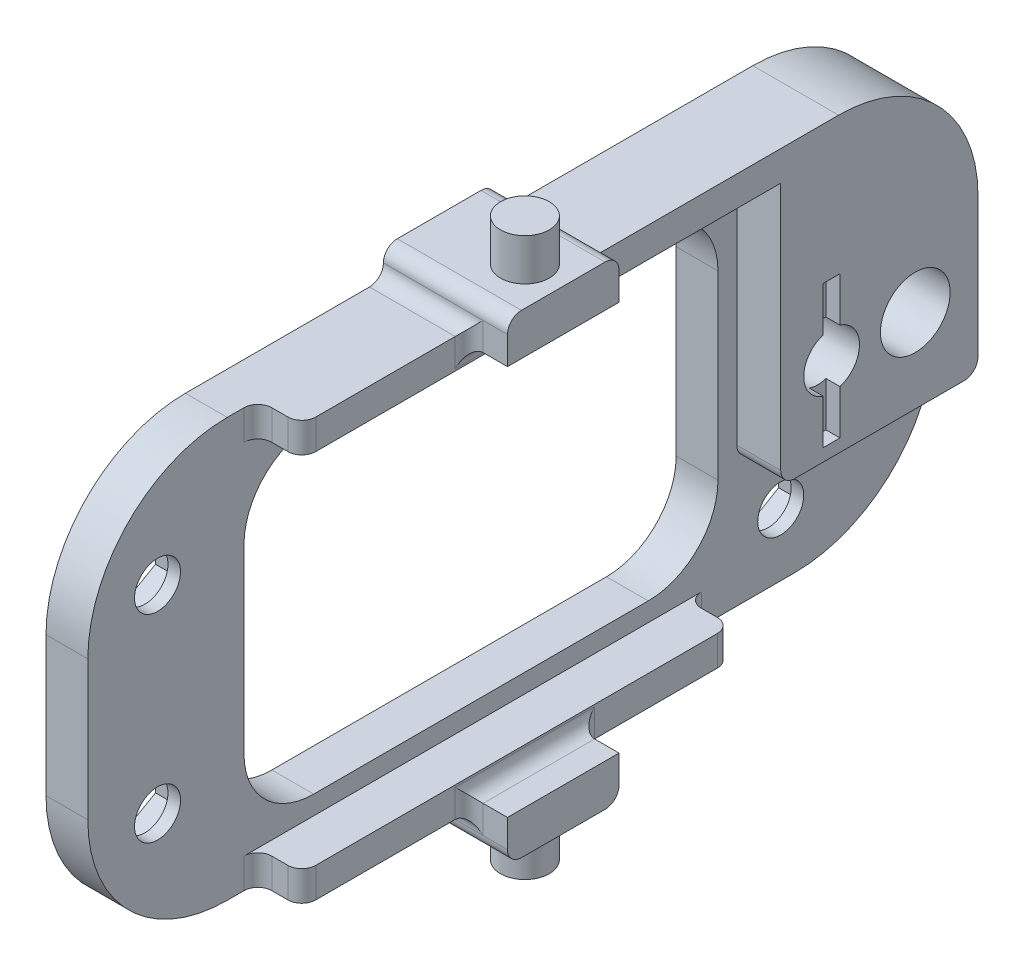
ISO-10303-21;
HEADER;
FILE_DESCRIPTION(('STEP AP214'),'2;1');
FILE_NAME('part.step','',(''),(''),'','','');
FILE_SCHEMA(('AUTOMOTIVE_DESIGN { 1 0 10303 214 1 1 1 1 }'));
ENDSEC;
DATA;
#1=APPLICATION_CONTEXT('core data for automotive mechanical design processes');
#2=APPLICATION_PROTOCOL_DEFINITION('international standard','automotive_design',2000,#1);
#3=PRODUCT_CONTEXT('',#1,'mechanical');
#4=PRODUCT('Part','Part','',(#3));
#5=PRODUCT_RELATED_PRODUCT_CATEGORY('part','',(#4));
#6=PRODUCT_DEFINITION_FORMATION('','',#4);
#7=PRODUCT_DEFINITION_CONTEXT('part definition',#1,'design');
#8=PRODUCT_DEFINITION('design','',#6,#7);
#9=PRODUCT_DEFINITION_SHAPE('','',#8);
#10=(LENGTH_UNIT() NAMED_UNIT(*) SI_UNIT(.MILLI.,.METRE.));
#11=(NAMED_UNIT(*) PLANE_ANGLE_UNIT() SI_UNIT($,.RADIAN.));
#12=(NAMED_UNIT(*) SI_UNIT($,.STERADIAN.) SOLID_ANGLE_UNIT());
#13=UNCERTAINTY_MEASURE_WITH_UNIT(LENGTH_MEASURE(1.E-05),#10,'distance_accuracy_value','');
#14=(GEOMETRIC_REPRESENTATION_CONTEXT(3) GLOBAL_UNCERTAINTY_ASSIGNED_CONTEXT((#13)) GLOBAL_UNIT_ASSIGNED_CONTEXT((#10,
#11,#12)) REPRESENTATION_CONTEXT('',''));
#15=CARTESIAN_POINT('',(0.,0.,0.));
#16=DIRECTION('',(0.,0.,1.));
#17=DIRECTION('',(1.,0.,0.));
#18=AXIS2_PLACEMENT_3D('',#15,#16,#17);
#19=CARTESIAN_POINT('',(0.,0.,0.));
#20=DIRECTION('',(1.,0.,0.));
#21=DIRECTION('',(0.,0.,-1.));
#22=AXIS2_PLACEMENT_3D('',#19,#20,#21);
#23=PLANE('',#22);
#24=CARTESIAN_POINT('',(0.,0.,-22.));
#25=DIRECTION('',(1.,0.,0.));
#26=DIRECTION('',(0.,0.,-1.));
#27=AXIS2_PLACEMENT_3D('',#24,#25,#26);
#28=CIRCLE('',#27,2.);
#29=CARTESIAN_POINT('',(0.,0.,-24.));
#30=VERTEX_POINT('',#29);
#31=EDGE_CURVE('E845',#30,#30,#28,.T.);
#32=ORIENTED_EDGE('',*,*,#31,.T.);
#33=EDGE_LOOP('',(#32));
#34=FACE_BOUND('',#33,.T.);
#35=DIRECTION('',(0.,-1.,0.));
#36=VECTOR('',#35,1.);
#37=CARTESIAN_POINT('',(0.,11.5,17.));
#38=LINE('',#37,#36);
#39=CARTESIAN_POINT('',(0.,6.5,17.));
#40=VERTEX_POINT('',#39);
#41=CARTESIAN_POINT('',(0.,-6.5,17.));
#42=VERTEX_POINT('',#41);
#43=EDGE_CURVE('E856',#40,#42,#38,.T.);
#44=ORIENTED_EDGE('',*,*,#43,.T.);
#45=CARTESIAN_POINT('',(0.,-6.5,12.));
#46=DIRECTION('',(1.,0.,0.));
#47=DIRECTION('',(0.,0.,-1.));
#48=AXIS2_PLACEMENT_3D('',#45,#46,#47);
#49=CIRCLE('',#48,5.);
#50=CARTESIAN_POINT('',(0.,-11.5,12.));
#51=VERTEX_POINT('',#50);
#52=EDGE_CURVE('E1177',#42,#51,#49,.T.);
#53=ORIENTED_EDGE('',*,*,#52,.T.);
#54=DIRECTION('',(0.,0.,-1.));
#55=VECTOR('',#54,1.);
#56=CARTESIAN_POINT('',(0.,-11.5,-17.));
#57=LINE('',#56,#55);
#58=CARTESIAN_POINT('',(0.,-11.5,-12.));
#59=VERTEX_POINT('',#58);
#60=EDGE_CURVE('E851',#51,#59,#57,.T.);
#61=ORIENTED_EDGE('',*,*,#60,.T.);
#62=CARTESIAN_POINT('',(0.,-6.5,-12.));
#63=DIRECTION('',(1.,0.,0.));
#64=DIRECTION('',(0.,0.,-1.));
#65=AXIS2_PLACEMENT_3D('',#62,#63,#64);
#66=CIRCLE('',#65,5.);
#67=CARTESIAN_POINT('',(0.,-6.5,-17.));
#68=VERTEX_POINT('',#67);
#69=EDGE_CURVE('E1169',#59,#68,#66,.T.);
#70=ORIENTED_EDGE('',*,*,#69,.T.);
#71=DIRECTION('',(0.,1.,0.));
#72=VECTOR('',#71,1.);
#73=CARTESIAN_POINT('',(0.,11.5,-17.));
#74=LINE('',#73,#72);
#75=CARTESIAN_POINT('',(0.,6.5,-17.));
#76=VERTEX_POINT('',#75);
#77=EDGE_CURVE('E867',#68,#76,#74,.T.);
#78=ORIENTED_EDGE('',*,*,#77,.T.);
#79=CARTESIAN_POINT('',(0.,6.5,-12.));
#80=DIRECTION('',(1.,0.,0.));
#81=DIRECTION('',(0.,0.,-1.));
#82=AXIS2_PLACEMENT_3D('',#79,#80,#81);
#83=CIRCLE('',#82,5.);
#84=CARTESIAN_POINT('',(0.,11.5,-12.));
#85=VERTEX_POINT('',#84);
#86=EDGE_CURVE('E1165',#76,#85,#83,.T.);
#87=ORIENTED_EDGE('',*,*,#86,.T.);
#88=DIRECTION('',(0.,0.,1.));
#89=VECTOR('',#88,1.);
#90=CARTESIAN_POINT('',(0.,11.5,-17.));
#91=LINE('',#90,#89);
#92=CARTESIAN_POINT('',(0.,11.5,12.));
#93=VERTEX_POINT('',#92);
#94=EDGE_CURVE('E870',#85,#93,#91,.T.);
#95=ORIENTED_EDGE('',*,*,#94,.T.);
#96=CARTESIAN_POINT('',(0.,6.5,12.));
#97=DIRECTION('',(1.,0.,0.));
#98=DIRECTION('',(0.,0.,-1.));
#99=AXIS2_PLACEMENT_3D('',#96,#97,#98);
#100=CIRCLE('',#99,5.);
#101=EDGE_CURVE('E1173',#93,#40,#100,.T.);
#102=ORIENTED_EDGE('',*,*,#101,.T.);
#103=EDGE_LOOP('',(#44,#53,#61,#70,#78,#87,#95,#102));
#104=FACE_BOUND('',#103,.T.);
#105=DIRECTION('',(0.,0.,1.));
#106=VECTOR('',#105,1.);
#107=CARTESIAN_POINT('',(0.,15.,4.));
#108=LINE('',#107,#106);
#109=CARTESIAN_POINT('',(0.,15.,5.));
#110=VERTEX_POINT('',#109);
#111=CARTESIAN_POINT('',(0.,15.,18.2));
#112=VERTEX_POINT('',#111);
#113=EDGE_CURVE('E879',#110,#112,#108,.T.);
#114=ORIENTED_EDGE('',*,*,#113,.F.);
#115=CARTESIAN_POINT('',(0.,16.,5.));
#116=DIRECTION('',(1.,0.,0.));
#117=DIRECTION('',(0.,0.,-1.));
#118=AXIS2_PLACEMENT_3D('',#115,#116,#117);
#119=CIRCLE('',#118,1.);
#120=CARTESIAN_POINT('',(0.,16.,4.));
#121=VERTEX_POINT('',#120);
#122=EDGE_CURVE('E1105',#110,#121,#119,.T.);
#123=ORIENTED_EDGE('',*,*,#122,.T.);
#124=CARTESIAN_POINT('',(0.,16.,3.));
#125=DIRECTION('',(1.,0.,0.));
#126=DIRECTION('',(0.,0.,-1.));
#127=AXIS2_PLACEMENT_3D('',#124,#125,#126);
#128=CIRCLE('',#127,1.);
#129=CARTESIAN_POINT('',(0.,17.,3.));
#130=VERTEX_POINT('',#129);
#131=EDGE_CURVE('E1067',#121,#130,#128,.F.);
#132=ORIENTED_EDGE('',*,*,#131,.T.);
#133=DIRECTION('',(0.,0.,1.));
#134=VECTOR('',#133,1.);
#135=CARTESIAN_POINT('',(0.,17.,4.));
#136=LINE('',#135,#134);
#137=CARTESIAN_POINT('',(0.,17.,-3.));
#138=VERTEX_POINT('',#137);
#139=EDGE_CURVE('E901',#138,#130,#136,.T.);
#140=ORIENTED_EDGE('',*,*,#139,.F.);
#141=CARTESIAN_POINT('',(0.,16.,-3.));
#142=DIRECTION('',(1.,0.,0.));
#143=DIRECTION('',(0.,0.,-1.));
#144=AXIS2_PLACEMENT_3D('',#141,#142,#143);
#145=CIRCLE('',#144,1.);
#146=CARTESIAN_POINT('',(0.,16.,-4.));
#147=VERTEX_POINT('',#146);
#148=EDGE_CURVE('E1065',#138,#147,#145,.F.);
#149=ORIENTED_EDGE('',*,*,#148,.T.);
#150=CARTESIAN_POINT('',(0.,16.,-5.));
#151=DIRECTION('',(1.,0.,0.));
#152=DIRECTION('',(0.,0.,-1.));
#153=AXIS2_PLACEMENT_3D('',#150,#151,#152);
#154=CIRCLE('',#153,1.);
#155=CARTESIAN_POINT('',(0.,15.,-5.));
#156=VERTEX_POINT('',#155);
#157=EDGE_CURVE('E1107',#147,#156,#154,.T.);
#158=ORIENTED_EDGE('',*,*,#157,.T.);
#159=DIRECTION('',(0.,0.,1.));
#160=VECTOR('',#159,1.);
#161=CARTESIAN_POINT('',(0.,15.,-32.5));
#162=LINE('',#161,#160);
#163=CARTESIAN_POINT('',(0.,15.,-22.5));
#164=VERTEX_POINT('',#163);
#165=EDGE_CURVE('E898',#164,#156,#162,.T.);
#166=ORIENTED_EDGE('',*,*,#165,.F.);
#167=CARTESIAN_POINT('',(0.,4.99999999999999,-22.5));
#168=DIRECTION('',(1.,0.,0.));
#169=DIRECTION('',(0.,0.,-1.));
#170=AXIS2_PLACEMENT_3D('',#167,#168,#169);
#171=CIRCLE('',#170,10.);
#172=CARTESIAN_POINT('',(0.,4.99999999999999,-32.5));
#173=VERTEX_POINT('',#172);
#174=EDGE_CURVE('E935',#164,#173,#171,.F.);
#175=ORIENTED_EDGE('',*,*,#174,.T.);
#176=DIRECTION('',(0.,1.,0.));
#177=VECTOR('',#176,1.);
#178=CARTESIAN_POINT('',(0.,-15.,-32.5));
#179=LINE('',#178,#177);
#180=CARTESIAN_POINT('',(0.,-5.,-32.5));
#181=VERTEX_POINT('',#180);
#182=EDGE_CURVE('E895',#181,#173,#179,.T.);
#183=ORIENTED_EDGE('',*,*,#182,.F.);
#184=CARTESIAN_POINT('',(0.,-5.,-22.5));
#185=DIRECTION('',(1.,0.,0.));
#186=DIRECTION('',(0.,0.,-1.));
#187=AXIS2_PLACEMENT_3D('',#184,#185,#186);
#188=CIRCLE('',#187,10.);
#189=CARTESIAN_POINT('',(0.,-15.,-22.5));
#190=VERTEX_POINT('',#189);
#191=EDGE_CURVE('E932',#181,#190,#188,.F.);
#192=ORIENTED_EDGE('',*,*,#191,.T.);
#193=DIRECTION('',(0.,0.,-1.));
#194=VECTOR('',#193,1.);
#195=CARTESIAN_POINT('',(0.,-15.,-4.));
#196=LINE('',#195,#194);
#197=CARTESIAN_POINT('',(0.,-15.,-5.));
#198=VERTEX_POINT('',#197);
#199=EDGE_CURVE('E893',#198,#190,#196,.T.);
#200=ORIENTED_EDGE('',*,*,#199,.F.);
#201=CARTESIAN_POINT('',(0.,-16.,-5.));
#202=DIRECTION('',(1.,0.,0.));
#203=DIRECTION('',(0.,0.,-1.));
#204=AXIS2_PLACEMENT_3D('',#201,#202,#203);
#205=CIRCLE('',#204,1.);
#206=CARTESIAN_POINT('',(0.,-16.,-4.));
#207=VERTEX_POINT('',#206);
#208=EDGE_CURVE('E1109',#198,#207,#205,.T.);
#209=ORIENTED_EDGE('',*,*,#208,.T.);
#210=CARTESIAN_POINT('',(0.,-16.,-3.));
#211=DIRECTION('',(1.,0.,0.));
#212=DIRECTION('',(0.,0.,-1.));
#213=AXIS2_PLACEMENT_3D('',#210,#211,#212);
#214=CIRCLE('',#213,1.);
#215=CARTESIAN_POINT('',(0.,-17.,-3.));
#216=VERTEX_POINT('',#215);
#217=EDGE_CURVE('E1063',#207,#216,#214,.F.);
#218=ORIENTED_EDGE('',*,*,#217,.T.);
#219=DIRECTION('',(0.,0.,-1.));
#220=VECTOR('',#219,1.);
#221=CARTESIAN_POINT('',(0.,-17.,4.));
#222=LINE('',#221,#220);
#223=CARTESIAN_POINT('',(0.,-17.,3.));
#224=VERTEX_POINT('',#223);
#225=EDGE_CURVE('E890',#224,#216,#222,.T.);
#226=ORIENTED_EDGE('',*,*,#225,.F.);
#227=CARTESIAN_POINT('',(0.,-16.,3.));
#228=DIRECTION('',(1.,0.,0.));
#229=DIRECTION('',(0.,0.,-1.));
#230=AXIS2_PLACEMENT_3D('',#227,#228,#229);
#231=CIRCLE('',#230,1.);
#232=CARTESIAN_POINT('',(0.,-16.,4.));
#233=VERTEX_POINT('',#232);
#234=EDGE_CURVE('E1061',#224,#233,#231,.F.);
#235=ORIENTED_EDGE('',*,*,#234,.T.);
#236=CARTESIAN_POINT('',(0.,-16.,5.));
#237=DIRECTION('',(1.,0.,0.));
#238=DIRECTION('',(0.,0.,-1.));
#239=AXIS2_PLACEMENT_3D('',#236,#237,#238);
#240=CIRCLE('',#239,1.);
#241=CARTESIAN_POINT('',(0.,-15.,5.));
#242=VERTEX_POINT('',#241);
#243=EDGE_CURVE('E1111',#233,#242,#240,.T.);
#244=ORIENTED_EDGE('',*,*,#243,.T.);
#245=DIRECTION('',(0.,0.,-1.));
#246=VECTOR('',#245,1.);
#247=CARTESIAN_POINT('',(0.,-15.,28.2));
#248=LINE('',#247,#246);
#249=CARTESIAN_POINT('',(0.,-15.,18.2));
#250=VERTEX_POINT('',#249);
#251=EDGE_CURVE('E887',#250,#242,#248,.T.);
#252=ORIENTED_EDGE('',*,*,#251,.F.);
#253=CARTESIAN_POINT('',(0.,-5.,18.2));
#254=DIRECTION('',(1.,0.,0.));
#255=DIRECTION('',(0.,0.,-1.));
#256=AXIS2_PLACEMENT_3D('',#253,#254,#255);
#257=CIRCLE('',#256,10.);
#258=CARTESIAN_POINT('',(0.,-5.,28.2));
#259=VERTEX_POINT('',#258);
#260=EDGE_CURVE('E930',#250,#259,#257,.F.);
#261=ORIENTED_EDGE('',*,*,#260,.T.);
#262=DIRECTION('',(0.,-1.,0.));
#263=VECTOR('',#262,1.);
#264=CARTESIAN_POINT('',(0.,-15.,28.2));
#265=LINE('',#264,#263);
#266=CARTESIAN_POINT('',(0.,5.,28.2));
#267=VERTEX_POINT('',#266);
#268=EDGE_CURVE('E864',#267,#259,#265,.T.);
#269=ORIENTED_EDGE('',*,*,#268,.F.);
#270=CARTESIAN_POINT('',(0.,5.,18.2));
#271=DIRECTION('',(1.,0.,0.));
#272=DIRECTION('',(0.,0.,-1.));
#273=AXIS2_PLACEMENT_3D('',#270,#271,#272);
#274=CIRCLE('',#273,10.);
#275=EDGE_CURVE('E937',#267,#112,#274,.F.);
#276=ORIENTED_EDGE('',*,*,#275,.T.);
#277=EDGE_LOOP('',(#114,#123,#132,#140,#149,#158,#166,#175,#183,#192,#200,#209,#218,#226,#235,
#244,#252,#261,#269,#276));
#278=FACE_BOUND('',#277,.T.);
#279=DIRECTION('',(0.,0.499999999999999,-0.866025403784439));
#280=VECTOR('',#279,1.);
#281=CARTESIAN_POINT('',(0.,-8.85455173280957,-18.65));
#282=LINE('',#281,#280);
#283=CARTESIAN_POINT('',(0.,-8.85455173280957,-18.65));
#284=VERTEX_POINT('',#283);
#285=CARTESIAN_POINT('',(0.,-7.20910346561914,-21.5));
#286=VERTEX_POINT('',#285);
#287=EDGE_CURVE('E669',#284,#286,#282,.T.);
#288=ORIENTED_EDGE('',*,*,#287,.F.);
#289=DIRECTION('',(0.,1.,0.));
#290=VECTOR('',#289,1.);
#291=CARTESIAN_POINT('',(0.,-12.1454482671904,-18.65));
#292=LINE('',#291,#290);
#293=CARTESIAN_POINT('',(0.,-12.1454482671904,-18.65));
#294=VERTEX_POINT('',#293);
#295=EDGE_CURVE('E607',#294,#284,#292,.T.);
#296=ORIENTED_EDGE('',*,*,#295,.F.);
#297=DIRECTION('',(0.,0.500000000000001,0.866025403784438));
#298=VECTOR('',#297,1.);
#299=CARTESIAN_POINT('',(0.,-13.7908965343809,-21.5));
#300=LINE('',#299,#298);
#301=CARTESIAN_POINT('',(0.,-13.7908965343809,-21.5));
#302=VERTEX_POINT('',#301);
#303=EDGE_CURVE('E656',#302,#294,#300,.T.);
#304=ORIENTED_EDGE('',*,*,#303,.F.);
#305=DIRECTION('',(0.,-0.499999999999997,0.86602540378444));
#306=VECTOR('',#305,1.);
#307=CARTESIAN_POINT('',(0.,-12.1454482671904,-24.35));
#308=LINE('',#307,#306);
#309=CARTESIAN_POINT('',(0.,-12.1454482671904,-24.35));
#310=VERTEX_POINT('',#309);
#311=EDGE_CURVE('E659',#310,#302,#308,.T.);
#312=ORIENTED_EDGE('',*,*,#311,.F.);
#313=DIRECTION('',(0.,-1.,0.));
#314=VECTOR('',#313,1.);
#315=CARTESIAN_POINT('',(0.,-8.85455173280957,-24.35));
#316=LINE('',#315,#314);
#317=CARTESIAN_POINT('',(0.,-8.85455173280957,-24.35));
#318=VERTEX_POINT('',#317);
#319=EDGE_CURVE('E663',#318,#310,#316,.T.);
#320=ORIENTED_EDGE('',*,*,#319,.F.);
#321=DIRECTION('',(0.,-0.5,-0.866025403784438));
#322=VECTOR('',#321,1.);
#323=CARTESIAN_POINT('',(0.,-7.20910346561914,-21.5));
#324=LINE('',#323,#322);
#325=EDGE_CURVE('E666',#286,#318,#324,.T.);
#326=ORIENTED_EDGE('',*,*,#325,.F.);
#327=EDGE_LOOP('',(#288,#296,#304,#312,#320,#326));
#328=FACE_BOUND('',#327,.T.);
#329=DIRECTION('',(0.,1.,0.));
#330=VECTOR('',#329,1.);
#331=CARTESIAN_POINT('',(0.,-8.74544826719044,26.05));
#332=LINE('',#331,#330);
#333=CARTESIAN_POINT('',(0.,-8.74544826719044,26.05));
#334=VERTEX_POINT('',#333);
#335=CARTESIAN_POINT('',(0.,-5.45455173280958,26.05));
#336=VERTEX_POINT('',#335);
#337=EDGE_CURVE('E621',#334,#336,#332,.T.);
#338=ORIENTED_EDGE('',*,*,#337,.F.);
#339=DIRECTION('',(0.,0.500000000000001,0.866025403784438));
#340=VECTOR('',#339,1.);
#341=CARTESIAN_POINT('',(0.,-10.3908965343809,23.2));
#342=LINE('',#341,#340);
#343=CARTESIAN_POINT('',(0.,-10.3908965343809,23.2));
#344=VERTEX_POINT('',#343);
#345=EDGE_CURVE('E573',#344,#334,#342,.T.);
#346=ORIENTED_EDGE('',*,*,#345,.F.);
#347=DIRECTION('',(0.,-0.5,0.866025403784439));
#348=VECTOR('',#347,1.);
#349=CARTESIAN_POINT('',(0.,-8.74544826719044,20.35));
#350=LINE('',#349,#348);
#351=CARTESIAN_POINT('',(0.,-8.74544826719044,20.35));
#352=VERTEX_POINT('',#351);
#353=EDGE_CURVE('E608',#352,#344,#350,.T.);
#354=ORIENTED_EDGE('',*,*,#353,.F.);
#355=DIRECTION('',(0.,-1.,0.));
#356=VECTOR('',#355,1.);
#357=CARTESIAN_POINT('',(0.,-5.45455173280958,20.35));
#358=LINE('',#357,#356);
#359=CARTESIAN_POINT('',(0.,-5.45455173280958,20.35));
#360=VERTEX_POINT('',#359);
#361=EDGE_CURVE('E611',#360,#352,#358,.T.);
#362=ORIENTED_EDGE('',*,*,#361,.F.);
#363=DIRECTION('',(0.,-0.5,-0.866025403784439));
#364=VECTOR('',#363,1.);
#365=CARTESIAN_POINT('',(0.,-3.80910346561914,23.2));
#366=LINE('',#365,#364);
#367=CARTESIAN_POINT('',(0.,-3.80910346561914,23.2));
#368=VERTEX_POINT('',#367);
#369=EDGE_CURVE('E615',#368,#360,#366,.T.);
#370=ORIENTED_EDGE('',*,*,#369,.F.);
#371=DIRECTION('',(0.,0.5,-0.866025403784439));
#372=VECTOR('',#371,1.);
#373=CARTESIAN_POINT('',(0.,-5.45455173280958,26.05));
#374=LINE('',#373,#372);
#375=EDGE_CURVE('E618',#336,#368,#374,.T.);
#376=ORIENTED_EDGE('',*,*,#375,.F.);
#377=EDGE_LOOP('',(#338,#346,#354,#362,#370,#376));
#378=FACE_BOUND('',#377,.T.);
#379=DIRECTION('',(0.,1.,0.));
#380=VECTOR('',#379,1.);
#381=CARTESIAN_POINT('',(0.,5.45455173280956,26.05));
#382=LINE('',#381,#380);
#383=CARTESIAN_POINT('',(0.,5.45455173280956,26.05));
#384=VERTEX_POINT('',#383);
#385=CARTESIAN_POINT('',(0.,8.74544826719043,26.05));
#386=VERTEX_POINT('',#385);
#387=EDGE_CURVE('E572',#384,#386,#382,.T.);
#388=ORIENTED_EDGE('',*,*,#387,.F.);
#389=DIRECTION('',(0.,0.5,0.866025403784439));
#390=VECTOR('',#389,1.);
#391=CARTESIAN_POINT('',(0.,3.80910346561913,23.2));
#392=LINE('',#391,#390);
#393=CARTESIAN_POINT('',(0.,3.80910346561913,23.2));
#394=VERTEX_POINT('',#393);
#395=EDGE_CURVE('E540',#394,#384,#392,.T.);
#396=ORIENTED_EDGE('',*,*,#395,.F.);
#397=DIRECTION('',(0.,-0.5,0.866025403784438));
#398=VECTOR('',#397,1.);
#399=CARTESIAN_POINT('',(0.,5.45455173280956,20.35));
#400=LINE('',#399,#398);
#401=CARTESIAN_POINT('',(0.,5.45455173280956,20.35));
#402=VERTEX_POINT('',#401);
#403=EDGE_CURVE('E558',#402,#394,#400,.T.);
#404=ORIENTED_EDGE('',*,*,#403,.F.);
#405=DIRECTION('',(0.,-1.,0.));
#406=VECTOR('',#405,1.);
#407=CARTESIAN_POINT('',(0.,8.74544826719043,20.35));
#408=LINE('',#407,#406);
#409=CARTESIAN_POINT('',(0.,8.74544826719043,20.35));
#410=VERTEX_POINT('',#409);
#411=EDGE_CURVE('E561',#410,#402,#408,.T.);
#412=ORIENTED_EDGE('',*,*,#411,.F.);
#413=DIRECTION('',(0.,-0.5,-0.866025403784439));
#414=VECTOR('',#413,1.);
#415=CARTESIAN_POINT('',(0.,10.3908965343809,23.2));
#416=LINE('',#415,#414);
#417=CARTESIAN_POINT('',(0.,10.3908965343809,23.2));
#418=VERTEX_POINT('',#417);
#419=EDGE_CURVE('E578',#418,#410,#416,.T.);
#420=ORIENTED_EDGE('',*,*,#419,.F.);
#421=DIRECTION('',(0.,0.499999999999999,-0.866025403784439));
#422=VECTOR('',#421,1.);
#423=CARTESIAN_POINT('',(0.,8.74544826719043,26.05));
#424=LINE('',#423,#422);
#425=EDGE_CURVE('E575',#386,#418,#424,.T.);
#426=ORIENTED_EDGE('',*,*,#425,.F.);
#427=EDGE_LOOP('',(#388,#396,#404,#412,#420,#426));
#428=FACE_BOUND('',#427,.T.);
#429=CARTESIAN_POINT('',(0.,0.,-28.));
#430=DIRECTION('',(1.,0.,0.));
#431=DIRECTION('',(0.,0.,-1.));
#432=AXIS2_PLACEMENT_3D('',#429,#430,#431);
#433=CIRCLE('',#432,3.5);
#434=CARTESIAN_POINT('',(0.,0.,-31.5));
#435=VERTEX_POINT('',#434);
#436=EDGE_CURVE('E11',#435,#435,#433,.F.);
#437=ORIENTED_EDGE('',*,*,#436,.F.);
#438=EDGE_LOOP('',(#437));
#439=FACE_BOUND('',#438,.T.);
#440=ADVANCED_FACE('F43',(#34,#104,#278,#328,#378,#428,#439),#23,.F.);
#441=CARTESIAN_POINT('',(3.,-10.5,-21.5));
#442=DIRECTION('',(-1.,0.,0.));
#443=DIRECTION('',(0.,0.,1.));
#444=AXIS2_PLACEMENT_3D('',#441,#442,#443);
#445=CYLINDRICAL_SURFACE('',#444,1.65);
#446=CARTESIAN_POINT('',(3.,-10.5,-21.5));
#447=DIRECTION('',(1.,0.,0.));
#448=DIRECTION('',(0.,0.,-1.));
#449=AXIS2_PLACEMENT_3D('',#446,#447,#448);
#450=CIRCLE('',#449,1.65);
#451=CARTESIAN_POINT('',(3.,-10.5,-23.15));
#452=VERTEX_POINT('',#451);
#453=EDGE_CURVE('E848',#452,#452,#450,.T.);
#454=ORIENTED_EDGE('',*,*,#453,.T.);
#455=EDGE_LOOP('',(#454));
#456=FACE_BOUND('',#455,.T.);
#457=CARTESIAN_POINT('',(2.1,-10.5,-21.5));
#458=DIRECTION('',(-1.,0.,0.));
#459=DIRECTION('',(0.,0.,1.));
#460=AXIS2_PLACEMENT_3D('',#457,#458,#459);
#461=CIRCLE('',#460,1.65);
#462=CARTESIAN_POINT('',(2.1,-10.5,-19.85));
#463=VERTEX_POINT('',#462);
#464=EDGE_CURVE('E707',#463,#463,#461,.T.);
#465=ORIENTED_EDGE('',*,*,#464,.T.);
#466=EDGE_LOOP('',(#465));
#467=FACE_BOUND('',#466,.T.);
#468=ADVANCED_FACE('F1220',(#456,#467),#445,.F.);
#469=CARTESIAN_POINT('',(3.,-7.1,23.2));
#470=DIRECTION('',(-1.,0.,0.));
#471=DIRECTION('',(0.,0.,1.));
#472=AXIS2_PLACEMENT_3D('',#469,#470,#471);
#473=CYLINDRICAL_SURFACE('',#472,1.65);
#474=CARTESIAN_POINT('',(3.,-7.1,23.2));
#475=DIRECTION('',(1.,0.,0.));
#476=DIRECTION('',(0.,0.,-1.));
#477=AXIS2_PLACEMENT_3D('',#474,#475,#476);
#478=CIRCLE('',#477,1.65);
#479=CARTESIAN_POINT('',(3.,-7.1,21.55));
#480=VERTEX_POINT('',#479);
#481=EDGE_CURVE('E839',#480,#480,#478,.T.);
#482=ORIENTED_EDGE('',*,*,#481,.T.);
#483=EDGE_LOOP('',(#482));
#484=FACE_BOUND('',#483,.T.);
#485=CARTESIAN_POINT('',(2.1,-7.1,23.2));
#486=DIRECTION('',(-1.,0.,0.));
#487=DIRECTION('',(0.,0.,1.));
#488=AXIS2_PLACEMENT_3D('',#485,#486,#487);
#489=CIRCLE('',#488,1.65);
#490=CARTESIAN_POINT('',(2.1,-7.1,24.85));
#491=VERTEX_POINT('',#490);
#492=EDGE_CURVE('E921',#491,#491,#489,.T.);
#493=ORIENTED_EDGE('',*,*,#492,.T.);
#494=EDGE_LOOP('',(#493));
#495=FACE_BOUND('',#494,.T.);
#496=ADVANCED_FACE('F1229',(#484,#495),#473,.F.);
#497=CARTESIAN_POINT('',(3.,7.1,23.2));
#498=DIRECTION('',(-1.,0.,0.));
#499=DIRECTION('',(0.,0.,1.));
#500=AXIS2_PLACEMENT_3D('',#497,#498,#499);
#501=CYLINDRICAL_SURFACE('',#500,1.65);
#502=CARTESIAN_POINT('',(3.,7.1,23.2));
#503=DIRECTION('',(1.,0.,0.));
#504=DIRECTION('',(0.,0.,-1.));
#505=AXIS2_PLACEMENT_3D('',#502,#503,#504);
#506=CIRCLE('',#505,1.65);
#507=CARTESIAN_POINT('',(3.,7.1,21.55));
#508=VERTEX_POINT('',#507);
#509=EDGE_CURVE('E796',#508,#508,#506,.T.);
#510=ORIENTED_EDGE('',*,*,#509,.T.);
#511=EDGE_LOOP('',(#510));
#512=FACE_BOUND('',#511,.T.);
#513=CARTESIAN_POINT('',(2.1,7.1,23.2));
#514=DIRECTION('',(-1.,0.,0.));
#515=DIRECTION('',(0.,0.,1.));
#516=AXIS2_PLACEMENT_3D('',#513,#514,#515);
#517=CIRCLE('',#516,1.65);
#518=CARTESIAN_POINT('',(2.1,7.1,24.85));
#519=VERTEX_POINT('',#518);
#520=EDGE_CURVE('E585',#519,#519,#517,.T.);
#521=ORIENTED_EDGE('',*,*,#520,.T.);
#522=EDGE_LOOP('',(#521));
#523=FACE_BOUND('',#522,.T.);
#524=ADVANCED_FACE('F1259',(#512,#523),#501,.F.);
#525=CARTESIAN_POINT('',(6.15,0.,0.));
#526=DIRECTION('',(-1.,0.,0.));
#527=DIRECTION('',(0.,0.,1.));
#528=AXIS2_PLACEMENT_3D('',#525,#526,#527);
#529=PLANE('',#528);
#530=CARTESIAN_POINT('',(6.15,0.,-28.));
#531=DIRECTION('',(1.,0.,0.));
#532=DIRECTION('',(0.,0.,-1.));
#533=AXIS2_PLACEMENT_3D('',#530,#531,#532);
#534=CIRCLE('',#533,2.5);
#535=CARTESIAN_POINT('',(6.15,0.,-30.5));
#536=VERTEX_POINT('',#535);
#537=EDGE_CURVE('E784',#536,#536,#534,.T.);
#538=ORIENTED_EDGE('',*,*,#537,.F.);
#539=EDGE_LOOP('',(#538));
#540=FACE_BOUND('',#539,.T.);
#541=CARTESIAN_POINT('',(6.15,0.,-22.));
#542=DIRECTION('',(1.,0.,0.));
#543=DIRECTION('',(0.,0.,-1.));
#544=AXIS2_PLACEMENT_3D('',#541,#542,#543);
#545=CIRCLE('',#544,2.);
#546=CARTESIAN_POINT('',(6.15,1.9078784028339,-21.4));
#547=VERTEX_POINT('',#546);
#548=CARTESIAN_POINT('',(6.15,-1.9078784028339,-21.4));
#549=VERTEX_POINT('',#548);
#550=EDGE_CURVE('E834',#547,#549,#545,.T.);
#551=ORIENTED_EDGE('',*,*,#550,.F.);
#552=DIRECTION('',(0.,-1.,0.));
#553=VECTOR('',#552,1.);
#554=CARTESIAN_POINT('',(6.15,-5.1,-21.4));
#555=LINE('',#554,#553);
#556=CARTESIAN_POINT('',(6.15,5.1,-21.4));
#557=VERTEX_POINT('',#556);
#558=EDGE_CURVE('E693',#557,#547,#555,.T.);
#559=ORIENTED_EDGE('',*,*,#558,.F.);
#560=DIRECTION('',(0.,0.,1.));
#561=VECTOR('',#560,1.);
#562=CARTESIAN_POINT('',(6.15,5.1,-21.4));
#563=LINE('',#562,#561);
#564=CARTESIAN_POINT('',(6.15,5.1,-22.6));
#565=VERTEX_POINT('',#564);
#566=EDGE_CURVE('E710',#565,#557,#563,.T.);
#567=ORIENTED_EDGE('',*,*,#566,.F.);
#568=DIRECTION('',(0.,1.,0.));
#569=VECTOR('',#568,1.);
#570=CARTESIAN_POINT('',(6.15,-5.1,-22.6));
#571=LINE('',#570,#569);
#572=CARTESIAN_POINT('',(6.15,1.90787840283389,-22.6));
#573=VERTEX_POINT('',#572);
#574=EDGE_CURVE('E706',#573,#565,#571,.T.);
#575=ORIENTED_EDGE('',*,*,#574,.F.);
#576=CARTESIAN_POINT('',(6.15,-1.90787840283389,-22.6));
#577=VERTEX_POINT('',#576);
#578=EDGE_CURVE('E816',#577,#573,#545,.T.);
#579=ORIENTED_EDGE('',*,*,#578,.F.);
#580=CARTESIAN_POINT('',(6.15,-5.1,-22.6));
#581=VERTEX_POINT('',#580);
#582=EDGE_CURVE('E708',#581,#577,#571,.T.);
#583=ORIENTED_EDGE('',*,*,#582,.F.);
#584=DIRECTION('',(0.,0.,-1.));
#585=VECTOR('',#584,1.);
#586=CARTESIAN_POINT('',(6.15,-5.1,-21.4));
#587=LINE('',#586,#585);
#588=CARTESIAN_POINT('',(6.15,-5.1,-21.4));
#589=VERTEX_POINT('',#588);
#590=EDGE_CURVE('E703',#589,#581,#587,.T.);
#591=ORIENTED_EDGE('',*,*,#590,.F.);
#592=EDGE_CURVE('E713',#549,#589,#555,.T.);
#593=ORIENTED_EDGE('',*,*,#592,.F.);
#594=EDGE_LOOP('',(#551,#559,#567,#575,#579,#583,#591,#593));
#595=FACE_BOUND('',#594,.T.);
#596=DIRECTION('',(0.,-1.,0.));
#597=VECTOR('',#596,1.);
#598=CARTESIAN_POINT('',(6.15,-6.,-18.35));
#599=LINE('',#598,#597);
#600=CARTESIAN_POINT('',(6.15,12.85,-18.35));
#601=VERTEX_POINT('',#600);
#602=CARTESIAN_POINT('',(6.15,-5.,-18.35));
#603=VERTEX_POINT('',#602);
#604=EDGE_CURVE('E819',#601,#603,#599,.T.);
#605=ORIENTED_EDGE('',*,*,#604,.T.);
#606=CARTESIAN_POINT('',(6.15,-5.,-19.35));
#607=DIRECTION('',(-1.,0.,0.));
#608=DIRECTION('',(0.,0.,1.));
#609=AXIS2_PLACEMENT_3D('',#606,#607,#608);
#610=CIRCLE('',#609,1.);
#611=CARTESIAN_POINT('',(6.15,-6.,-19.35));
#612=VERTEX_POINT('',#611);
#613=EDGE_CURVE('E985',#603,#612,#610,.F.);
#614=ORIENTED_EDGE('',*,*,#613,.T.);
#615=DIRECTION('',(0.,0.,-1.));
#616=VECTOR('',#615,1.);
#617=CARTESIAN_POINT('',(6.15,-6.,-18.35));
#618=LINE('',#617,#616);
#619=CARTESIAN_POINT('',(6.15,-6.,-31.5));
#620=VERTEX_POINT('',#619);
#621=EDGE_CURVE('E805',#612,#620,#618,.T.);
#622=ORIENTED_EDGE('',*,*,#621,.T.);
#623=CARTESIAN_POINT('',(6.15,-5.,-31.5));
#624=DIRECTION('',(-1.,0.,0.));
#625=DIRECTION('',(0.,0.,1.));
#626=AXIS2_PLACEMENT_3D('',#623,#624,#625);
#627=CIRCLE('',#626,1.);
#628=CARTESIAN_POINT('',(6.15,-5.,-32.5));
#629=VERTEX_POINT('',#628);
#630=EDGE_CURVE('E983',#620,#629,#627,.F.);
#631=ORIENTED_EDGE('',*,*,#630,.T.);
#632=DIRECTION('',(0.,1.,0.));
#633=VECTOR('',#632,1.);
#634=CARTESIAN_POINT('',(6.15,-6.,-32.5));
#635=LINE('',#634,#633);
#636=CARTESIAN_POINT('',(6.15,4.99999999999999,-32.5));
#637=VERTEX_POINT('',#636);
#638=EDGE_CURVE('E810',#629,#637,#635,.T.);
#639=ORIENTED_EDGE('',*,*,#638,.T.);
#640=CARTESIAN_POINT('',(6.15,4.99999999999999,-22.5));
#641=DIRECTION('',(-1.,0.,0.));
#642=DIRECTION('',(0.,0.,1.));
#643=AXIS2_PLACEMENT_3D('',#640,#641,#642);
#644=CIRCLE('',#643,10.);
#645=CARTESIAN_POINT('',(6.15,15.,-22.5));
#646=VERTEX_POINT('',#645);
#647=EDGE_CURVE('E958',#637,#646,#644,.F.);
#648=ORIENTED_EDGE('',*,*,#647,.T.);
#649=DIRECTION('',(0.,0.,1.));
#650=VECTOR('',#649,1.);
#651=CARTESIAN_POINT('',(6.15,15.,-4.));
#652=LINE('',#651,#650);
#653=CARTESIAN_POINT('',(6.15,15.,-5.));
#654=VERTEX_POINT('',#653);
#655=EDGE_CURVE('E827',#646,#654,#652,.T.);
#656=ORIENTED_EDGE('',*,*,#655,.T.);
#657=DIRECTION('',(0.,1.,0.));
#658=VECTOR('',#657,1.);
#659=CARTESIAN_POINT('',(6.15,14.,-5.));
#660=LINE('',#659,#658);
#661=CARTESIAN_POINT('',(6.15,13.,-5.));
#662=VERTEX_POINT('',#661);
#663=EDGE_CURVE('E976',#654,#662,#660,.F.);
#664=ORIENTED_EDGE('',*,*,#663,.T.);
#665=DIRECTION('',(0.,0.,-1.));
#666=VECTOR('',#665,1.);
#667=CARTESIAN_POINT('',(6.15,13.,4.));
#668=LINE('',#667,#666);
#669=CARTESIAN_POINT('',(6.15,13.,5.));
#670=VERTEX_POINT('',#669);
#671=EDGE_CURVE('E974',#662,#670,#668,.F.);
#672=ORIENTED_EDGE('',*,*,#671,.T.);
#673=DIRECTION('',(0.,-1.,0.));
#674=VECTOR('',#673,1.);
#675=CARTESIAN_POINT('',(6.15,15.,5.));
#676=LINE('',#675,#674);
#677=CARTESIAN_POINT('',(6.15,15.,5.));
#678=VERTEX_POINT('',#677);
#679=EDGE_CURVE('E978',#670,#678,#676,.F.);
#680=ORIENTED_EDGE('',*,*,#679,.T.);
#681=DIRECTION('',(0.,0.,1.));
#682=VECTOR('',#681,1.);
#683=CARTESIAN_POINT('',(6.15,15.,16.));
#684=LINE('',#683,#682);
#685=CARTESIAN_POINT('',(6.15,15.,15.));
#686=VERTEX_POINT('',#685);
#687=EDGE_CURVE('E824',#678,#686,#684,.T.);
#688=ORIENTED_EDGE('',*,*,#687,.T.);
#689=DIRECTION('',(0.,-1.,0.));
#690=VECTOR('',#689,1.);
#691=CARTESIAN_POINT('',(6.15,0.,15.));
#692=LINE('',#691,#690);
#693=CARTESIAN_POINT('',(6.15,12.85,15.));
#694=VERTEX_POINT('',#693);
#695=EDGE_CURVE('E980',#686,#694,#692,.T.);
#696=ORIENTED_EDGE('',*,*,#695,.T.);
#697=DIRECTION('',(0.,0.,-1.));
#698=VECTOR('',#697,1.);
#699=CARTESIAN_POINT('',(6.15,12.85,16.));
#700=LINE('',#699,#698);
#701=EDGE_CURVE('E822',#694,#601,#700,.T.);
#702=ORIENTED_EDGE('',*,*,#701,.T.);
#703=EDGE_LOOP('',(#605,#614,#622,#631,#639,#648,#656,#664,#672,#680,#688,#696,#702));
#704=FACE_BOUND('',#703,.T.);
#705=ADVANCED_FACE('F1243',(#540,#595,#704),#529,.F.);
#706=CARTESIAN_POINT('',(3.,0.,0.));
#707=DIRECTION('',(1.,0.,0.));
#708=DIRECTION('',(0.,0.,-1.));
#709=AXIS2_PLACEMENT_3D('',#706,#707,#708);
#710=PLANE('',#709);
#711=DIRECTION('',(0.,0.,1.));
#712=VECTOR('',#711,1.);
#713=CARTESIAN_POINT('',(3.,-12.85,16.));
#714=LINE('',#713,#712);
#715=CARTESIAN_POINT('',(3.,-12.85,-15.8));
#716=VERTEX_POINT('',#715);
#717=CARTESIAN_POINT('',(3.,-12.85,17.));
#718=VERTEX_POINT('',#717);
#719=EDGE_CURVE('E776',#716,#718,#714,.T.);
#720=ORIENTED_EDGE('',*,*,#719,.F.);
#721=DIRECTION('',(0.,1.,0.));
#722=VECTOR('',#721,1.);
#723=CARTESIAN_POINT('',(3.,0.,-15.8));
#724=LINE('',#723,#722);
#725=CARTESIAN_POINT('',(3.,-15.,-15.8));
#726=VERTEX_POINT('',#725);
#727=EDGE_CURVE('E1017',#716,#726,#724,.F.);
#728=ORIENTED_EDGE('',*,*,#727,.T.);
#729=DIRECTION('',(0.,0.,-1.));
#730=VECTOR('',#729,1.);
#731=CARTESIAN_POINT('',(3.,-15.,-4.));
#732=LINE('',#731,#730);
#733=CARTESIAN_POINT('',(3.,-15.,-22.5));
#734=VERTEX_POINT('',#733);
#735=EDGE_CURVE('E882',#726,#734,#732,.T.);
#736=ORIENTED_EDGE('',*,*,#735,.T.);
#737=CARTESIAN_POINT('',(3.,-5.,-22.5));
#738=DIRECTION('',(1.,0.,0.));
#739=DIRECTION('',(0.,0.,-1.));
#740=AXIS2_PLACEMENT_3D('',#737,#738,#739);
#741=CIRCLE('',#740,10.);
#742=CARTESIAN_POINT('',(3.,-5.,-32.5));
#743=VERTEX_POINT('',#742);
#744=EDGE_CURVE('E945',#734,#743,#741,.T.);
#745=ORIENTED_EDGE('',*,*,#744,.T.);
#746=CARTESIAN_POINT('',(3.,-5.,-31.5));
#747=DIRECTION('',(1.,0.,0.));
#748=DIRECTION('',(0.,0.,-1.));
#749=AXIS2_PLACEMENT_3D('',#746,#747,#748);
#750=CIRCLE('',#749,1.);
#751=CARTESIAN_POINT('',(3.,-6.,-31.5));
#752=VERTEX_POINT('',#751);
#753=EDGE_CURVE('E1089',#743,#752,#750,.F.);
#754=ORIENTED_EDGE('',*,*,#753,.T.);
#755=DIRECTION('',(0.,0.,-1.));
#756=VECTOR('',#755,1.);
#757=CARTESIAN_POINT('',(3.,-6.,-18.35));
#758=LINE('',#757,#756);
#759=CARTESIAN_POINT('',(3.,-6.,-19.35));
#760=VERTEX_POINT('',#759);
#761=EDGE_CURVE('E806',#760,#752,#758,.T.);
#762=ORIENTED_EDGE('',*,*,#761,.F.);
#763=CARTESIAN_POINT('',(3.,-5.,-19.35));
#764=DIRECTION('',(1.,0.,0.));
#765=DIRECTION('',(0.,0.,-1.));
#766=AXIS2_PLACEMENT_3D('',#763,#764,#765);
#767=CIRCLE('',#766,1.);
#768=CARTESIAN_POINT('',(3.,-5.,-18.35));
#769=VERTEX_POINT('',#768);
#770=EDGE_CURVE('E1087',#760,#769,#767,.F.);
#771=ORIENTED_EDGE('',*,*,#770,.T.);
#772=DIRECTION('',(0.,-1.,0.));
#773=VECTOR('',#772,1.);
#774=CARTESIAN_POINT('',(3.,-6.,-18.35));
#775=LINE('',#774,#773);
#776=CARTESIAN_POINT('',(3.,12.85,-18.35));
#777=VERTEX_POINT('',#776);
#778=EDGE_CURVE('E809',#777,#769,#775,.T.);
#779=ORIENTED_EDGE('',*,*,#778,.F.);
#780=DIRECTION('',(0.,0.,-1.));
#781=VECTOR('',#780,1.);
#782=CARTESIAN_POINT('',(3.,12.85,16.));
#783=LINE('',#782,#781);
#784=CARTESIAN_POINT('',(3.,12.85,17.));
#785=VERTEX_POINT('',#784);
#786=EDGE_CURVE('E813',#785,#777,#783,.T.);
#787=ORIENTED_EDGE('',*,*,#786,.F.);
#788=DIRECTION('',(0.,-1.,0.));
#789=VECTOR('',#788,1.);
#790=CARTESIAN_POINT('',(3.,0.,17.));
#791=LINE('',#790,#789);
#792=CARTESIAN_POINT('',(3.,15.,17.));
#793=VERTEX_POINT('',#792);
#794=EDGE_CURVE('E1012',#785,#793,#791,.F.);
#795=ORIENTED_EDGE('',*,*,#794,.T.);
#796=DIRECTION('',(0.,0.,1.));
#797=VECTOR('',#796,1.);
#798=CARTESIAN_POINT('',(3.,15.,4.));
#799=LINE('',#798,#797);
#800=CARTESIAN_POINT('',(3.,15.,18.2));
#801=VERTEX_POINT('',#800);
#802=EDGE_CURVE('E738',#793,#801,#799,.T.);
#803=ORIENTED_EDGE('',*,*,#802,.T.);
#804=CARTESIAN_POINT('',(3.,5.,18.2));
#805=DIRECTION('',(1.,0.,0.));
#806=DIRECTION('',(0.,0.,-1.));
#807=AXIS2_PLACEMENT_3D('',#804,#805,#806);
#808=CIRCLE('',#807,10.);
#809=CARTESIAN_POINT('',(3.,5.,28.2));
#810=VERTEX_POINT('',#809);
#811=EDGE_CURVE('E947',#801,#810,#808,.T.);
#812=ORIENTED_EDGE('',*,*,#811,.T.);
#813=DIRECTION('',(0.,-1.,0.));
#814=VECTOR('',#813,1.);
#815=CARTESIAN_POINT('',(3.,-15.,28.2));
#816=LINE('',#815,#814);
#817=CARTESIAN_POINT('',(3.,-5.,28.2));
#818=VERTEX_POINT('',#817);
#819=EDGE_CURVE('E875',#810,#818,#816,.T.);
#820=ORIENTED_EDGE('',*,*,#819,.T.);
#821=CARTESIAN_POINT('',(3.,-5.,18.2));
#822=DIRECTION('',(1.,0.,0.));
#823=DIRECTION('',(0.,0.,-1.));
#824=AXIS2_PLACEMENT_3D('',#821,#822,#823);
#825=CIRCLE('',#824,10.);
#826=CARTESIAN_POINT('',(3.,-15.,18.2));
#827=VERTEX_POINT('',#826);
#828=EDGE_CURVE('E943',#818,#827,#825,.T.);
#829=ORIENTED_EDGE('',*,*,#828,.T.);
#830=DIRECTION('',(0.,0.,-1.));
#831=VECTOR('',#830,1.);
#832=CARTESIAN_POINT('',(3.,-15.,28.2));
#833=LINE('',#832,#831);
#834=CARTESIAN_POINT('',(3.,-15.,17.));
#835=VERTEX_POINT('',#834);
#836=EDGE_CURVE('E878',#827,#835,#833,.T.);
#837=ORIENTED_EDGE('',*,*,#836,.T.);
#838=DIRECTION('',(0.,-1.,0.));
#839=VECTOR('',#838,1.);
#840=CARTESIAN_POINT('',(3.,0.,17.));
#841=LINE('',#840,#839);
#842=EDGE_CURVE('E1014',#835,#718,#841,.F.);
#843=ORIENTED_EDGE('',*,*,#842,.T.);
#844=EDGE_LOOP('',(#720,#728,#736,#745,#754,#762,#771,#779,#787,#795,#803,#812,#820,#829,#837,#843));
#845=FACE_BOUND('',#844,.T.);
#846=ORIENTED_EDGE('',*,*,#481,.F.);
#847=EDGE_LOOP('',(#846));
#848=FACE_BOUND('',#847,.T.);
#849=DIRECTION('',(0.,1.,0.));
#850=VECTOR('',#849,1.);
#851=CARTESIAN_POINT('',(3.,11.5,-17.));
#852=LINE('',#851,#850);
#853=CARTESIAN_POINT('',(3.,-6.5,-17.));
#854=VERTEX_POINT('',#853);
#855=CARTESIAN_POINT('',(3.,6.5,-17.));
#856=VERTEX_POINT('',#855);
#857=EDGE_CURVE('E855',#854,#856,#852,.T.);
#858=ORIENTED_EDGE('',*,*,#857,.F.);
#859=CARTESIAN_POINT('',(3.,-6.5,-12.));
#860=DIRECTION('',(1.,0.,0.));
#861=DIRECTION('',(0.,0.,-1.));
#862=AXIS2_PLACEMENT_3D('',#859,#860,#861);
#863=CIRCLE('',#862,5.);
#864=CARTESIAN_POINT('',(3.,-11.5,-12.));
#865=VERTEX_POINT('',#864);
#866=EDGE_CURVE('E1171',#854,#865,#863,.F.);
#867=ORIENTED_EDGE('',*,*,#866,.T.);
#868=DIRECTION('',(0.,0.,-1.));
#869=VECTOR('',#868,1.);
#870=CARTESIAN_POINT('',(3.,-11.5,-17.));
#871=LINE('',#870,#869);
#872=CARTESIAN_POINT('',(3.,-11.5,12.));
#873=VERTEX_POINT('',#872);
#874=EDGE_CURVE('E852',#873,#865,#871,.T.);
#875=ORIENTED_EDGE('',*,*,#874,.F.);
#876=CARTESIAN_POINT('',(3.,-6.5,12.));
#877=DIRECTION('',(1.,0.,0.));
#878=DIRECTION('',(0.,0.,-1.));
#879=AXIS2_PLACEMENT_3D('',#876,#877,#878);
#880=CIRCLE('',#879,5.);
#881=CARTESIAN_POINT('',(3.,-6.5,17.));
#882=VERTEX_POINT('',#881);
#883=EDGE_CURVE('E52',#873,#882,#880,.F.);
#884=ORIENTED_EDGE('',*,*,#883,.T.);
#885=DIRECTION('',(0.,-1.,0.));
#886=VECTOR('',#885,1.);
#887=CARTESIAN_POINT('',(3.,11.5,17.));
#888=LINE('',#887,#886);
#889=CARTESIAN_POINT('',(3.,6.5,17.));
#890=VERTEX_POINT('',#889);
#891=EDGE_CURVE('E862',#890,#882,#888,.T.);
#892=ORIENTED_EDGE('',*,*,#891,.F.);
#893=CARTESIAN_POINT('',(3.,6.5,12.));
#894=DIRECTION('',(1.,0.,0.));
#895=DIRECTION('',(0.,0.,-1.));
#896=AXIS2_PLACEMENT_3D('',#893,#894,#895);
#897=CIRCLE('',#896,5.);
#898=CARTESIAN_POINT('',(3.,11.5,12.));
#899=VERTEX_POINT('',#898);
#900=EDGE_CURVE('E1175',#890,#899,#897,.F.);
#901=ORIENTED_EDGE('',*,*,#900,.T.);
#902=DIRECTION('',(0.,0.,1.));
#903=VECTOR('',#902,1.);
#904=CARTESIAN_POINT('',(3.,11.5,-17.));
#905=LINE('',#904,#903);
#906=CARTESIAN_POINT('',(3.,11.5,-12.));
#907=VERTEX_POINT('',#906);
#908=EDGE_CURVE('E859',#907,#899,#905,.T.);
#909=ORIENTED_EDGE('',*,*,#908,.F.);
#910=CARTESIAN_POINT('',(3.,6.5,-12.));
#911=DIRECTION('',(1.,0.,0.));
#912=DIRECTION('',(0.,0.,-1.));
#913=AXIS2_PLACEMENT_3D('',#910,#911,#912);
#914=CIRCLE('',#913,5.);
#915=EDGE_CURVE('E1167',#907,#856,#914,.F.);
#916=ORIENTED_EDGE('',*,*,#915,.T.);
#917=EDGE_LOOP('',(#858,#867,#875,#884,#892,#901,#909,#916));
#918=FACE_BOUND('',#917,.T.);
#919=ORIENTED_EDGE('',*,*,#453,.F.);
#920=EDGE_LOOP('',(#919));
#921=FACE_BOUND('',#920,.T.);
#922=ORIENTED_EDGE('',*,*,#509,.F.);
#923=EDGE_LOOP('',(#922));
#924=FACE_BOUND('',#923,.T.);
#925=ADVANCED_FACE('F1190',(#845,#848,#918,#921,#924),#710,.T.);
#926=ORIENTED_EDGE('',*,*,#436,.T.);
#927=EDGE_LOOP('',(#926));
#928=FACE_BOUND('',#927,.T.);
#929=CARTESIAN_POINT('',(0.,0.,-28.));
#930=DIRECTION('',(1.,0.,0.));
#931=DIRECTION('',(0.,0.,-1.));
#932=AXIS2_PLACEMENT_3D('',#929,#930,#931);
#933=CIRCLE('',#932,2.5);
#934=CARTESIAN_POINT('',(0.,0.,-30.5));
#935=VERTEX_POINT('',#934);
#936=EDGE_CURVE('E842',#935,#935,#933,.T.);
#937=ORIENTED_EDGE('',*,*,#936,.T.);
#938=EDGE_LOOP('',(#937));
#939=FACE_BOUND('',#938,.T.);
#940=ADVANCED_FACE('F1223',(#928,#939),#23,.F.);
#941=CARTESIAN_POINT('',(3.,-15.,28.2));
#942=DIRECTION('',(0.,0.,-1.));
#943=DIRECTION('',(-1.,0.,0.));
#944=AXIS2_PLACEMENT_3D('',#941,#942,#943);
#945=PLANE('',#944);
#946=ORIENTED_EDGE('',*,*,#819,.F.);
#947=DIRECTION('',(-1.,0.,0.));
#948=VECTOR('',#947,1.);
#949=CARTESIAN_POINT('',(3.,5.,28.2));
#950=LINE('',#949,#948);
#951=EDGE_CURVE('E927',#810,#267,#950,.T.);
#952=ORIENTED_EDGE('',*,*,#951,.T.);
#953=ORIENTED_EDGE('',*,*,#268,.T.);
#954=DIRECTION('',(-1.,0.,0.));
#955=VECTOR('',#954,1.);
#956=CARTESIAN_POINT('',(3.,-5.,28.2));
#957=LINE('',#956,#955);
#958=EDGE_CURVE('E918',#259,#818,#957,.F.);
#959=ORIENTED_EDGE('',*,*,#958,.T.);
#960=EDGE_LOOP('',(#946,#952,#953,#959));
#961=FACE_BOUND('',#960,.T.);
#962=ADVANCED_FACE('F1234',(#961),#945,.F.);
#963=CARTESIAN_POINT('',(3.,-15.,28.2));
#964=DIRECTION('',(0.,1.,0.));
#965=DIRECTION('',(0.,0.,1.));
#966=AXIS2_PLACEMENT_3D('',#963,#964,#965);
#967=PLANE('',#966);
#968=DIRECTION('',(0.,0.,-1.));
#969=VECTOR('',#968,1.);
#970=CARTESIAN_POINT('',(6.15,-15.,16.));
#971=LINE('',#970,#969);
#972=CARTESIAN_POINT('',(6.15,-15.,15.));
#973=VERTEX_POINT('',#972);
#974=CARTESIAN_POINT('',(6.15,-15.,5.));
#975=VERTEX_POINT('',#974);
#976=EDGE_CURVE('E779',#973,#975,#971,.T.);
#977=ORIENTED_EDGE('',*,*,#976,.F.);
#978=CARTESIAN_POINT('',(5.15,-15.,15.));
#979=DIRECTION('',(0.,1.,0.));
#980=DIRECTION('',(0.,0.,1.));
#981=AXIS2_PLACEMENT_3D('',#978,#979,#980);
#982=CIRCLE('',#981,1.);
#983=CARTESIAN_POINT('',(5.15,-15.,16.));
#984=VERTEX_POINT('',#983);
#985=EDGE_CURVE('E1032',#973,#984,#982,.F.);
#986=ORIENTED_EDGE('',*,*,#985,.T.);
#987=DIRECTION('',(-1.,0.,0.));
#988=VECTOR('',#987,1.);
#989=CARTESIAN_POINT('',(6.15,-15.,16.));
#990=LINE('',#989,#988);
#991=CARTESIAN_POINT('',(4.,-15.,16.));
#992=VERTEX_POINT('',#991);
#993=EDGE_CURVE('E782',#984,#992,#990,.T.);
#994=ORIENTED_EDGE('',*,*,#993,.T.);
#995=CARTESIAN_POINT('',(4.,-15.,17.));
#996=DIRECTION('',(0.,1.,0.));
#997=DIRECTION('',(0.,0.,1.));
#998=AXIS2_PLACEMENT_3D('',#995,#996,#997);
#999=CIRCLE('',#998,1.);
#1000=EDGE_CURVE('E1096',#992,#835,#999,.T.);
#1001=ORIENTED_EDGE('',*,*,#1000,.T.);
#1002=ORIENTED_EDGE('',*,*,#836,.F.);
#1003=DIRECTION('',(-1.,0.,0.));
#1004=VECTOR('',#1003,1.);
#1005=CARTESIAN_POINT('',(3.,-15.,18.2));
#1006=LINE('',#1005,#1004);
#1007=EDGE_CURVE('E963',#827,#250,#1006,.T.);
#1008=ORIENTED_EDGE('',*,*,#1007,.T.);
#1009=ORIENTED_EDGE('',*,*,#251,.T.);
#1010=DIRECTION('',(-1.,0.,0.));
#1011=VECTOR('',#1010,1.);
#1012=CARTESIAN_POINT('',(6.15,-15.,5.));
#1013=LINE('',#1012,#1011);
#1014=EDGE_CURVE('E1030',#242,#975,#1013,.F.);
#1015=ORIENTED_EDGE('',*,*,#1014,.T.);
#1016=EDGE_LOOP('',(#977,#986,#994,#1001,#1002,#1008,#1009,#1015));
#1017=FACE_BOUND('',#1016,.T.);
#1018=ADVANCED_FACE('F1239',(#1017),#967,.F.);
#1019=CARTESIAN_POINT('',(3.,-15.,4.));
#1020=DIRECTION('',(0.,0.,-1.));
#1021=DIRECTION('',(0.,1.,0.));
#1022=AXIS2_PLACEMENT_3D('',#1019,#1020,#1021);
#1023=PLANE('',#1022);
#1024=DIRECTION('',(-1.,0.,0.));
#1025=VECTOR('',#1024,1.);
#1026=CARTESIAN_POINT('',(8.9,-14.,4.));
#1027=LINE('',#1026,#1025);
#1028=CARTESIAN_POINT('',(8.9,-14.,4.));
#1029=VERTEX_POINT('',#1028);
#1030=CARTESIAN_POINT('',(7.15,-14.,4.));
#1031=VERTEX_POINT('',#1030);
#1032=EDGE_CURVE('E733',#1029,#1031,#1027,.T.);
#1033=ORIENTED_EDGE('',*,*,#1032,.T.);
#1034=DIRECTION('',(0.,-1.,0.));
#1035=VECTOR('',#1034,1.);
#1036=CARTESIAN_POINT('',(7.15,-15.,4.));
#1037=LINE('',#1036,#1035);
#1038=CARTESIAN_POINT('',(7.15,-16.,4.));
#1039=VERTEX_POINT('',#1038);
#1040=EDGE_CURVE('E1055',#1031,#1039,#1037,.T.);
#1041=ORIENTED_EDGE('',*,*,#1040,.T.);
#1042=DIRECTION('',(-1.,0.,0.));
#1043=VECTOR('',#1042,1.);
#1044=CARTESIAN_POINT('',(3.,-16.,4.));
#1045=LINE('',#1044,#1043);
#1046=CARTESIAN_POINT('',(8.9,-16.,4.));
#1047=VERTEX_POINT('',#1046);
#1048=EDGE_CURVE('E1053',#1039,#1047,#1045,.F.);
#1049=ORIENTED_EDGE('',*,*,#1048,.T.);
#1050=DIRECTION('',(0.,-1.,0.));
#1051=VECTOR('',#1050,1.);
#1052=CARTESIAN_POINT('',(8.9,-17.,4.));
#1053=LINE('',#1052,#1051);
#1054=EDGE_CURVE('E767',#1029,#1047,#1053,.T.);
#1055=ORIENTED_EDGE('',*,*,#1054,.F.);
#1056=EDGE_LOOP('',(#1033,#1041,#1049,#1055));
#1057=FACE_BOUND('',#1056,.T.);
#1058=ADVANCED_FACE('F1519',(#1057),#1023,.F.);
#1059=CARTESIAN_POINT('',(3.,-17.,4.));
#1060=DIRECTION('',(0.,1.,0.));
#1061=DIRECTION('',(0.,0.,1.));
#1062=AXIS2_PLACEMENT_3D('',#1059,#1060,#1061);
#1063=PLANE('',#1062);
#1064=CARTESIAN_POINT('',(6.15,-17.,0.));
#1065=DIRECTION('',(0.,-1.,0.));
#1066=DIRECTION('',(0.,0.,-1.));
#1067=AXIS2_PLACEMENT_3D('',#1064,#1065,#1066);
#1068=CIRCLE('',#1067,1.75);
#1069=CARTESIAN_POINT('',(6.15,-17.,-1.75));
#1070=VERTEX_POINT('',#1069);
#1071=EDGE_CURVE('E734',#1070,#1070,#1068,.T.);
#1072=ORIENTED_EDGE('',*,*,#1071,.F.);
#1073=EDGE_LOOP('',(#1072));
#1074=FACE_BOUND('',#1073,.T.);
#1075=ORIENTED_EDGE('',*,*,#225,.T.);
#1076=DIRECTION('',(-1.,0.,0.));
#1077=VECTOR('',#1076,1.);
#1078=CARTESIAN_POINT('',(3.,-17.,-3.));
#1079=LINE('',#1078,#1077);
#1080=CARTESIAN_POINT('',(8.9,-17.,-3.));
#1081=VERTEX_POINT('',#1080);
#1082=EDGE_CURVE('E1081',#216,#1081,#1079,.F.);
#1083=ORIENTED_EDGE('',*,*,#1082,.T.);
#1084=DIRECTION('',(0.,0.,-1.));
#1085=VECTOR('',#1084,1.);
#1086=CARTESIAN_POINT('',(8.9,-17.,-4.));
#1087=LINE('',#1086,#1085);
#1088=CARTESIAN_POINT('',(8.9,-17.,3.));
#1089=VERTEX_POINT('',#1088);
#1090=EDGE_CURVE('E764',#1089,#1081,#1087,.T.);
#1091=ORIENTED_EDGE('',*,*,#1090,.F.);
#1092=DIRECTION('',(-1.,0.,0.));
#1093=VECTOR('',#1092,1.);
#1094=CARTESIAN_POINT('',(3.,-17.,3.));
#1095=LINE('',#1094,#1093);
#1096=EDGE_CURVE('E1079',#1089,#224,#1095,.T.);
#1097=ORIENTED_EDGE('',*,*,#1096,.T.);
#1098=EDGE_LOOP('',(#1075,#1083,#1091,#1097));
#1099=FACE_BOUND('',#1098,.T.);
#1100=ADVANCED_FACE('F1515',(#1074,#1099),#1063,.F.);
#1101=CARTESIAN_POINT('',(3.,-17.,-4.));
#1102=DIRECTION('',(0.,0.,1.));
#1103=DIRECTION('',(0.,-1.,0.));
#1104=AXIS2_PLACEMENT_3D('',#1101,#1102,#1103);
#1105=PLANE('',#1104);
#1106=DIRECTION('',(-1.,0.,0.));
#1107=VECTOR('',#1106,1.);
#1108=CARTESIAN_POINT('',(3.,-16.,-4.));
#1109=LINE('',#1108,#1107);
#1110=CARTESIAN_POINT('',(8.9,-16.,-4.));
#1111=VERTEX_POINT('',#1110);
#1112=CARTESIAN_POINT('',(7.15,-16.,-4.));
#1113=VERTEX_POINT('',#1112);
#1114=EDGE_CURVE('E1048',#1111,#1113,#1109,.T.);
#1115=ORIENTED_EDGE('',*,*,#1114,.T.);
#1116=DIRECTION('',(0.,1.,0.));
#1117=VECTOR('',#1116,1.);
#1118=CARTESIAN_POINT('',(7.15,-17.,-4.));
#1119=LINE('',#1118,#1117);
#1120=CARTESIAN_POINT('',(7.15,-14.,-4.));
#1121=VERTEX_POINT('',#1120);
#1122=EDGE_CURVE('E1050',#1113,#1121,#1119,.T.);
#1123=ORIENTED_EDGE('',*,*,#1122,.T.);
#1124=DIRECTION('',(-1.,0.,0.));
#1125=VECTOR('',#1124,1.);
#1126=CARTESIAN_POINT('',(8.9,-14.,-4.));
#1127=LINE('',#1126,#1125);
#1128=CARTESIAN_POINT('',(8.9,-14.,-4.));
#1129=VERTEX_POINT('',#1128);
#1130=EDGE_CURVE('E759',#1129,#1121,#1127,.T.);
#1131=ORIENTED_EDGE('',*,*,#1130,.F.);
#1132=DIRECTION('',(0.,1.,0.));
#1133=VECTOR('',#1132,1.);
#1134=CARTESIAN_POINT('',(8.9,-14.,-4.));
#1135=LINE('',#1134,#1133);
#1136=EDGE_CURVE('E762',#1111,#1129,#1135,.T.);
#1137=ORIENTED_EDGE('',*,*,#1136,.F.);
#1138=EDGE_LOOP('',(#1115,#1123,#1131,#1137));
#1139=FACE_BOUND('',#1138,.T.);
#1140=ADVANCED_FACE('F1512',(#1139),#1105,.F.);
#1141=CARTESIAN_POINT('',(3.,-15.,-4.));
#1142=DIRECTION('',(0.,1.,0.));
#1143=DIRECTION('',(0.,0.,1.));
#1144=AXIS2_PLACEMENT_3D('',#1141,#1142,#1143);
#1145=PLANE('',#1144);
#1146=DIRECTION('',(-1.,0.,0.));
#1147=VECTOR('',#1146,1.);
#1148=CARTESIAN_POINT('',(6.15,-15.,-14.8));
#1149=LINE('',#1148,#1147);
#1150=CARTESIAN_POINT('',(5.15,-15.,-14.8));
#1151=VERTEX_POINT('',#1150);
#1152=CARTESIAN_POINT('',(4.,-15.,-14.8));
#1153=VERTEX_POINT('',#1152);
#1154=EDGE_CURVE('E793',#1151,#1153,#1149,.T.);
#1155=ORIENTED_EDGE('',*,*,#1154,.F.);
#1156=CARTESIAN_POINT('',(5.15,-15.,-13.8));
#1157=DIRECTION('',(0.,1.,0.));
#1158=DIRECTION('',(0.,0.,1.));
#1159=AXIS2_PLACEMENT_3D('',#1156,#1157,#1158);
#1160=CIRCLE('',#1159,1.);
#1161=CARTESIAN_POINT('',(6.15,-15.,-13.8));
#1162=VERTEX_POINT('',#1161);
#1163=EDGE_CURVE('E1010',#1151,#1162,#1160,.F.);
#1164=ORIENTED_EDGE('',*,*,#1163,.T.);
#1165=DIRECTION('',(0.,0.,-1.));
#1166=VECTOR('',#1165,1.);
#1167=CARTESIAN_POINT('',(6.15,-15.,-4.));
#1168=LINE('',#1167,#1166);
#1169=CARTESIAN_POINT('',(6.15,-15.,-5.));
#1170=VERTEX_POINT('',#1169);
#1171=EDGE_CURVE('E772',#1170,#1162,#1168,.T.);
#1172=ORIENTED_EDGE('',*,*,#1171,.F.);
#1173=DIRECTION('',(-1.,0.,0.));
#1174=VECTOR('',#1173,1.);
#1175=CARTESIAN_POINT('',(0.,-15.,-5.));
#1176=LINE('',#1175,#1174);
#1177=EDGE_CURVE('E1008',#1170,#198,#1176,.T.);
#1178=ORIENTED_EDGE('',*,*,#1177,.T.);
#1179=ORIENTED_EDGE('',*,*,#199,.T.);
#1180=DIRECTION('',(-1.,0.,0.));
#1181=VECTOR('',#1180,1.);
#1182=CARTESIAN_POINT('',(3.,-15.,-22.5));
#1183=LINE('',#1182,#1181);
#1184=EDGE_CURVE('E960',#190,#734,#1183,.F.);
#1185=ORIENTED_EDGE('',*,*,#1184,.T.);
#1186=ORIENTED_EDGE('',*,*,#735,.F.);
#1187=CARTESIAN_POINT('',(4.,-15.,-15.8));
#1188=DIRECTION('',(0.,1.,0.));
#1189=DIRECTION('',(0.,0.,1.));
#1190=AXIS2_PLACEMENT_3D('',#1187,#1188,#1189);
#1191=CIRCLE('',#1190,1.);
#1192=EDGE_CURVE('E1094',#726,#1153,#1191,.T.);
#1193=ORIENTED_EDGE('',*,*,#1192,.T.);
#1194=EDGE_LOOP('',(#1155,#1164,#1172,#1178,#1179,#1185,#1186,#1193));
#1195=FACE_BOUND('',#1194,.T.);
#1196=ADVANCED_FACE('F1484',(#1195),#1145,.F.);
#1197=CARTESIAN_POINT('',(3.,-15.,-32.5));
#1198=DIRECTION('',(0.,0.,1.));
#1199=DIRECTION('',(1.,0.,0.));
#1200=AXIS2_PLACEMENT_3D('',#1197,#1198,#1199);
#1201=PLANE('',#1200);
#1202=ORIENTED_EDGE('',*,*,#182,.T.);
#1203=DIRECTION('',(-1.,0.,0.));
#1204=VECTOR('',#1203,1.);
#1205=CARTESIAN_POINT('',(3.,4.99999999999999,-32.5));
#1206=LINE('',#1205,#1204);
#1207=EDGE_CURVE('E956',#173,#637,#1206,.F.);
#1208=ORIENTED_EDGE('',*,*,#1207,.T.);
#1209=ORIENTED_EDGE('',*,*,#638,.F.);
#1210=DIRECTION('',(-1.,0.,0.));
#1211=VECTOR('',#1210,1.);
#1212=CARTESIAN_POINT('',(3.,-5.,-32.5));
#1213=LINE('',#1212,#1211);
#1214=EDGE_CURVE('E953',#629,#743,#1213,.T.);
#1215=ORIENTED_EDGE('',*,*,#1214,.T.);
#1216=EDGE_CURVE('E952',#743,#181,#1213,.T.);
#1217=ORIENTED_EDGE('',*,*,#1216,.T.);
#1218=EDGE_LOOP('',(#1202,#1208,#1209,#1215,#1217));
#1219=FACE_BOUND('',#1218,.T.);
#1220=ADVANCED_FACE('F1290',(#1219),#1201,.F.);
#1221=CARTESIAN_POINT('',(3.,15.,-32.5));
#1222=DIRECTION('',(0.,-1.,0.));
#1223=DIRECTION('',(0.,0.,-1.));
#1224=AXIS2_PLACEMENT_3D('',#1221,#1222,#1223);
#1225=PLANE('',#1224);
#1226=ORIENTED_EDGE('',*,*,#165,.T.);
#1227=DIRECTION('',(-1.,0.,0.));
#1228=VECTOR('',#1227,1.);
#1229=CARTESIAN_POINT('',(6.15,15.,-5.));
#1230=LINE('',#1229,#1228);
#1231=EDGE_CURVE('E1077',#156,#654,#1230,.F.);
#1232=ORIENTED_EDGE('',*,*,#1231,.T.);
#1233=ORIENTED_EDGE('',*,*,#655,.F.);
#1234=DIRECTION('',(-1.,0.,0.));
#1235=VECTOR('',#1234,1.);
#1236=CARTESIAN_POINT('',(3.,15.,-22.5));
#1237=LINE('',#1236,#1235);
#1238=EDGE_CURVE('E949',#646,#164,#1237,.T.);
#1239=ORIENTED_EDGE('',*,*,#1238,.T.);
#1240=EDGE_LOOP('',(#1226,#1232,#1233,#1239));
#1241=FACE_BOUND('',#1240,.T.);
#1242=ADVANCED_FACE('F1299',(#1241),#1225,.F.);
#1243=CARTESIAN_POINT('',(3.,17.,-4.));
#1244=DIRECTION('',(0.,0.,1.));
#1245=DIRECTION('',(1.,0.,0.));
#1246=AXIS2_PLACEMENT_3D('',#1243,#1244,#1245);
#1247=PLANE('',#1246);
#1248=DIRECTION('',(-1.,0.,0.));
#1249=VECTOR('',#1248,1.);
#1250=CARTESIAN_POINT('',(8.9,14.,-4.));
#1251=LINE('',#1250,#1249);
#1252=CARTESIAN_POINT('',(8.9,14.,-4.));
#1253=VERTEX_POINT('',#1252);
#1254=CARTESIAN_POINT('',(7.15,14.,-4.));
#1255=VERTEX_POINT('',#1254);
#1256=EDGE_CURVE('E750',#1253,#1255,#1251,.T.);
#1257=ORIENTED_EDGE('',*,*,#1256,.T.);
#1258=DIRECTION('',(0.,1.,0.));
#1259=VECTOR('',#1258,1.);
#1260=CARTESIAN_POINT('',(7.15,15.,-4.));
#1261=LINE('',#1260,#1259);
#1262=CARTESIAN_POINT('',(7.15,16.,-4.));
#1263=VERTEX_POINT('',#1262);
#1264=EDGE_CURVE('E1046',#1255,#1263,#1261,.T.);
#1265=ORIENTED_EDGE('',*,*,#1264,.T.);
#1266=DIRECTION('',(-1.,0.,0.));
#1267=VECTOR('',#1266,1.);
#1268=CARTESIAN_POINT('',(3.,16.,-4.));
#1269=LINE('',#1268,#1267);
#1270=CARTESIAN_POINT('',(8.9,16.,-4.));
#1271=VERTEX_POINT('',#1270);
#1272=EDGE_CURVE('E1044',#1263,#1271,#1269,.F.);
#1273=ORIENTED_EDGE('',*,*,#1272,.T.);
#1274=DIRECTION('',(0.,1.,0.));
#1275=VECTOR('',#1274,1.);
#1276=CARTESIAN_POINT('',(8.9,14.,-4.));
#1277=LINE('',#1276,#1275);
#1278=EDGE_CURVE('E739',#1253,#1271,#1277,.T.);
#1279=ORIENTED_EDGE('',*,*,#1278,.F.);
#1280=EDGE_LOOP('',(#1257,#1265,#1273,#1279));
#1281=FACE_BOUND('',#1280,.T.);
#1282=ADVANCED_FACE('F1495',(#1281),#1247,.F.);
#1283=CARTESIAN_POINT('',(3.,17.,4.));
#1284=DIRECTION('',(0.,-1.,0.));
#1285=DIRECTION('',(0.,0.,-1.));
#1286=AXIS2_PLACEMENT_3D('',#1283,#1284,#1285);
#1287=PLANE('',#1286);
#1288=CARTESIAN_POINT('',(6.15,17.,0.));
#1289=DIRECTION('',(0.,-1.,0.));
#1290=DIRECTION('',(0.,0.,-1.));
#1291=AXIS2_PLACEMENT_3D('',#1288,#1289,#1290);
#1292=CIRCLE('',#1291,1.75);
#1293=CARTESIAN_POINT('',(6.15,17.,-1.75));
#1294=VERTEX_POINT('',#1293);
#1295=EDGE_CURVE('E718',#1294,#1294,#1292,.T.);
#1296=ORIENTED_EDGE('',*,*,#1295,.T.);
#1297=EDGE_LOOP('',(#1296));
#1298=FACE_BOUND('',#1297,.T.);
#1299=ORIENTED_EDGE('',*,*,#139,.T.);
#1300=DIRECTION('',(-1.,0.,0.));
#1301=VECTOR('',#1300,1.);
#1302=CARTESIAN_POINT('',(3.,17.,3.));
#1303=LINE('',#1302,#1301);
#1304=CARTESIAN_POINT('',(8.9,17.,3.));
#1305=VERTEX_POINT('',#1304);
#1306=EDGE_CURVE('E1071',#130,#1305,#1303,.F.);
#1307=ORIENTED_EDGE('',*,*,#1306,.T.);
#1308=DIRECTION('',(0.,0.,1.));
#1309=VECTOR('',#1308,1.);
#1310=CARTESIAN_POINT('',(8.9,17.,-4.));
#1311=LINE('',#1310,#1309);
#1312=CARTESIAN_POINT('',(8.9,17.,-3.));
#1313=VERTEX_POINT('',#1312);
#1314=EDGE_CURVE('E742',#1313,#1305,#1311,.T.);
#1315=ORIENTED_EDGE('',*,*,#1314,.F.);
#1316=DIRECTION('',(-1.,0.,0.));
#1317=VECTOR('',#1316,1.);
#1318=CARTESIAN_POINT('',(3.,17.,-3.));
#1319=LINE('',#1318,#1317);
#1320=EDGE_CURVE('E1069',#1313,#138,#1319,.T.);
#1321=ORIENTED_EDGE('',*,*,#1320,.T.);
#1322=EDGE_LOOP('',(#1299,#1307,#1315,#1321));
#1323=FACE_BOUND('',#1322,.T.);
#1324=ADVANCED_FACE('F1497',(#1298,#1323),#1287,.F.);
#1325=CARTESIAN_POINT('',(3.,15.,4.));
#1326=DIRECTION('',(0.,0.,-1.));
#1327=DIRECTION('',(-1.,0.,0.));
#1328=AXIS2_PLACEMENT_3D('',#1325,#1326,#1327);
#1329=PLANE('',#1328);
#1330=DIRECTION('',(-1.,0.,0.));
#1331=VECTOR('',#1330,1.);
#1332=CARTESIAN_POINT('',(3.,16.,4.));
#1333=LINE('',#1332,#1331);
#1334=CARTESIAN_POINT('',(8.9,16.,4.));
#1335=VERTEX_POINT('',#1334);
#1336=CARTESIAN_POINT('',(7.15,16.,4.));
#1337=VERTEX_POINT('',#1336);
#1338=EDGE_CURVE('E1039',#1335,#1337,#1333,.T.);
#1339=ORIENTED_EDGE('',*,*,#1338,.T.);
#1340=DIRECTION('',(0.,-1.,0.));
#1341=VECTOR('',#1340,1.);
#1342=CARTESIAN_POINT('',(7.15,14.,4.));
#1343=LINE('',#1342,#1341);
#1344=CARTESIAN_POINT('',(7.15,14.,4.));
#1345=VERTEX_POINT('',#1344);
#1346=EDGE_CURVE('E1041',#1337,#1345,#1343,.T.);
#1347=ORIENTED_EDGE('',*,*,#1346,.T.);
#1348=DIRECTION('',(-1.,0.,0.));
#1349=VECTOR('',#1348,1.);
#1350=CARTESIAN_POINT('',(8.9,14.,4.));
#1351=LINE('',#1350,#1349);
#1352=CARTESIAN_POINT('',(8.9,14.,4.));
#1353=VERTEX_POINT('',#1352);
#1354=EDGE_CURVE('E753',#1353,#1345,#1351,.T.);
#1355=ORIENTED_EDGE('',*,*,#1354,.F.);
#1356=DIRECTION('',(0.,-1.,0.));
#1357=VECTOR('',#1356,1.);
#1358=CARTESIAN_POINT('',(8.9,17.,4.));
#1359=LINE('',#1358,#1357);
#1360=EDGE_CURVE('E746',#1335,#1353,#1359,.T.);
#1361=ORIENTED_EDGE('',*,*,#1360,.F.);
#1362=EDGE_LOOP('',(#1339,#1347,#1355,#1361));
#1363=FACE_BOUND('',#1362,.T.);
#1364=ADVANCED_FACE('F1326',(#1363),#1329,.F.);
#1365=CARTESIAN_POINT('',(3.,15.,4.));
#1366=DIRECTION('',(0.,-1.,0.));
#1367=DIRECTION('',(0.,0.,-1.));
#1368=AXIS2_PLACEMENT_3D('',#1365,#1366,#1367);
#1369=PLANE('',#1368);
#1370=DIRECTION('',(-1.,0.,0.));
#1371=VECTOR('',#1370,1.);
#1372=CARTESIAN_POINT('',(6.15,15.,16.));
#1373=LINE('',#1372,#1371);
#1374=CARTESIAN_POINT('',(5.15,15.,16.));
#1375=VERTEX_POINT('',#1374);
#1376=CARTESIAN_POINT('',(4.,15.,16.));
#1377=VERTEX_POINT('',#1376);
#1378=EDGE_CURVE('E756',#1375,#1377,#1373,.T.);
#1379=ORIENTED_EDGE('',*,*,#1378,.F.);
#1380=CARTESIAN_POINT('',(5.15,15.,15.));
#1381=DIRECTION('',(0.,-1.,0.));
#1382=DIRECTION('',(0.,0.,-1.));
#1383=AXIS2_PLACEMENT_3D('',#1380,#1381,#1382);
#1384=CIRCLE('',#1383,1.);
#1385=EDGE_CURVE('E1028',#1375,#686,#1384,.F.);
#1386=ORIENTED_EDGE('',*,*,#1385,.T.);
#1387=ORIENTED_EDGE('',*,*,#687,.F.);
#1388=DIRECTION('',(-1.,0.,0.));
#1389=VECTOR('',#1388,1.);
#1390=CARTESIAN_POINT('',(0.,15.,5.));
#1391=LINE('',#1390,#1389);
#1392=EDGE_CURVE('E1026',#678,#110,#1391,.T.);
#1393=ORIENTED_EDGE('',*,*,#1392,.T.);
#1394=ORIENTED_EDGE('',*,*,#113,.T.);
#1395=DIRECTION('',(-1.,0.,0.));
#1396=VECTOR('',#1395,1.);
#1397=CARTESIAN_POINT('',(3.,15.,18.2));
#1398=LINE('',#1397,#1396);
#1399=EDGE_CURVE('E940',#112,#801,#1398,.F.);
#1400=ORIENTED_EDGE('',*,*,#1399,.T.);
#1401=ORIENTED_EDGE('',*,*,#802,.F.);
#1402=CARTESIAN_POINT('',(4.,15.,17.));
#1403=DIRECTION('',(0.,-1.,0.));
#1404=DIRECTION('',(0.,0.,-1.));
#1405=AXIS2_PLACEMENT_3D('',#1402,#1403,#1404);
#1406=CIRCLE('',#1405,1.);
#1407=EDGE_CURVE('E1103',#793,#1377,#1406,.T.);
#1408=ORIENTED_EDGE('',*,*,#1407,.T.);
#1409=EDGE_LOOP('',(#1379,#1386,#1387,#1393,#1394,#1400,#1401,#1408));
#1410=FACE_BOUND('',#1409,.T.);
#1411=ADVANCED_FACE('F1348',(#1410),#1369,.F.);
#1412=CARTESIAN_POINT('',(3.,-11.5,-17.));
#1413=DIRECTION('',(0.,1.,0.));
#1414=DIRECTION('',(0.,0.,1.));
#1415=AXIS2_PLACEMENT_3D('',#1412,#1413,#1414);
#1416=PLANE('',#1415);
#1417=ORIENTED_EDGE('',*,*,#874,.T.);
#1418=DIRECTION('',(-1.,0.,0.));
#1419=VECTOR('',#1418,1.);
#1420=CARTESIAN_POINT('',(0.,-11.5,-12.));
#1421=LINE('',#1420,#1419);
#1422=EDGE_CURVE('E1158',#865,#59,#1421,.T.);
#1423=ORIENTED_EDGE('',*,*,#1422,.T.);
#1424=ORIENTED_EDGE('',*,*,#60,.F.);
#1425=DIRECTION('',(-1.,0.,0.));
#1426=VECTOR('',#1425,1.);
#1427=CARTESIAN_POINT('',(3.,-11.5,12.));
#1428=LINE('',#1427,#1426);
#1429=EDGE_CURVE('E1156',#51,#873,#1428,.F.);
#1430=ORIENTED_EDGE('',*,*,#1429,.T.);
#1431=EDGE_LOOP('',(#1417,#1423,#1424,#1430));
#1432=FACE_BOUND('',#1431,.T.);
#1433=ADVANCED_FACE('F1185',(#1432),#1416,.T.);
#1434=CARTESIAN_POINT('',(3.,11.5,-17.));
#1435=DIRECTION('',(0.,0.,1.));
#1436=DIRECTION('',(1.,0.,0.));
#1437=AXIS2_PLACEMENT_3D('',#1434,#1435,#1436);
#1438=PLANE('',#1437);
#1439=ORIENTED_EDGE('',*,*,#857,.T.);
#1440=DIRECTION('',(-1.,0.,0.));
#1441=VECTOR('',#1440,1.);
#1442=CARTESIAN_POINT('',(0.,6.5,-17.));
#1443=LINE('',#1442,#1441);
#1444=EDGE_CURVE('E1148',#856,#76,#1443,.T.);
#1445=ORIENTED_EDGE('',*,*,#1444,.T.);
#1446=ORIENTED_EDGE('',*,*,#77,.F.);
#1447=DIRECTION('',(-1.,0.,0.));
#1448=VECTOR('',#1447,1.);
#1449=CARTESIAN_POINT('',(3.,-6.5,-17.));
#1450=LINE('',#1449,#1448);
#1451=EDGE_CURVE('E1113',#68,#854,#1450,.F.);
#1452=ORIENTED_EDGE('',*,*,#1451,.T.);
#1453=EDGE_LOOP('',(#1439,#1445,#1446,#1452));
#1454=FACE_BOUND('',#1453,.T.);
#1455=ADVANCED_FACE('F1206',(#1454),#1438,.T.);
#1456=CARTESIAN_POINT('',(3.,11.5,-17.));
#1457=DIRECTION('',(0.,-1.,0.));
#1458=DIRECTION('',(0.,0.,-1.));
#1459=AXIS2_PLACEMENT_3D('',#1456,#1457,#1458);
#1460=PLANE('',#1459);
#1461=ORIENTED_EDGE('',*,*,#94,.F.);
#1462=DIRECTION('',(-1.,0.,0.));
#1463=VECTOR('',#1462,1.);
#1464=CARTESIAN_POINT('',(3.,11.5,-12.));
#1465=LINE('',#1464,#1463);
#1466=EDGE_CURVE('E1154',#85,#907,#1465,.F.);
#1467=ORIENTED_EDGE('',*,*,#1466,.T.);
#1468=ORIENTED_EDGE('',*,*,#908,.T.);
#1469=DIRECTION('',(-1.,0.,0.));
#1470=VECTOR('',#1469,1.);
#1471=CARTESIAN_POINT('',(0.,11.5,12.));
#1472=LINE('',#1471,#1470);
#1473=EDGE_CURVE('E1151',#899,#93,#1472,.T.);
#1474=ORIENTED_EDGE('',*,*,#1473,.T.);
#1475=EDGE_LOOP('',(#1461,#1467,#1468,#1474));
#1476=FACE_BOUND('',#1475,.T.);
#1477=ADVANCED_FACE('F1198',(#1476),#1460,.T.);
#1478=CARTESIAN_POINT('',(3.,11.5,17.));
#1479=DIRECTION('',(0.,0.,-1.));
#1480=DIRECTION('',(0.,1.,0.));
#1481=AXIS2_PLACEMENT_3D('',#1478,#1479,#1480);
#1482=PLANE('',#1481);
#1483=ORIENTED_EDGE('',*,*,#43,.F.);
#1484=DIRECTION('',(-1.,0.,0.));
#1485=VECTOR('',#1484,1.);
#1486=CARTESIAN_POINT('',(3.,6.5,17.));
#1487=LINE('',#1486,#1485);
#1488=EDGE_CURVE('E65',#40,#890,#1487,.F.);
#1489=ORIENTED_EDGE('',*,*,#1488,.T.);
#1490=ORIENTED_EDGE('',*,*,#891,.T.);
#1491=DIRECTION('',(-1.,0.,0.));
#1492=VECTOR('',#1491,1.);
#1493=CARTESIAN_POINT('',(0.,-6.5,17.));
#1494=LINE('',#1493,#1492);
#1495=EDGE_CURVE('E1161',#882,#42,#1494,.T.);
#1496=ORIENTED_EDGE('',*,*,#1495,.T.);
#1497=EDGE_LOOP('',(#1483,#1489,#1490,#1496));
#1498=FACE_BOUND('',#1497,.T.);
#1499=ADVANCED_FACE('F1187',(#1498),#1482,.T.);
#1500=CARTESIAN_POINT('',(3.,0.,-22.));
#1501=DIRECTION('',(-1.,0.,0.));
#1502=DIRECTION('',(0.,0.,1.));
#1503=AXIS2_PLACEMENT_3D('',#1500,#1501,#1502);
#1504=CYLINDRICAL_SURFACE('',#1503,2.);
#1505=DIRECTION('',(-1.,0.,0.));
#1506=VECTOR('',#1505,1.);
#1507=CARTESIAN_POINT('',(3.,1.9078784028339,-21.4));
#1508=LINE('',#1507,#1506);
#1509=CARTESIAN_POINT('',(5.15,1.9078784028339,-21.4));
#1510=VERTEX_POINT('',#1509);
#1511=EDGE_CURVE('E915',#547,#1510,#1508,.T.);
#1512=ORIENTED_EDGE('',*,*,#1511,.F.);
#1513=ORIENTED_EDGE('',*,*,#550,.T.);
#1514=DIRECTION('',(-1.,0.,0.));
#1515=VECTOR('',#1514,1.);
#1516=CARTESIAN_POINT('',(3.,-1.9078784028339,-21.4));
#1517=LINE('',#1516,#1515);
#1518=CARTESIAN_POINT('',(5.15,-1.9078784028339,-21.4));
#1519=VERTEX_POINT('',#1518);
#1520=EDGE_CURVE('E911',#1519,#549,#1517,.F.);
#1521=ORIENTED_EDGE('',*,*,#1520,.F.);
#1522=CARTESIAN_POINT('',(5.15,0.,-22.));
#1523=DIRECTION('',(1.,0.,0.));
#1524=DIRECTION('',(0.,0.,-1.));
#1525=AXIS2_PLACEMENT_3D('',#1522,#1523,#1524);
#1526=CIRCLE('',#1525,2.);
#1527=CARTESIAN_POINT('',(5.15,-1.90787840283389,-22.6));
#1528=VERTEX_POINT('',#1527);
#1529=EDGE_CURVE('E737',#1519,#1528,#1526,.T.);
#1530=ORIENTED_EDGE('',*,*,#1529,.T.);
#1531=DIRECTION('',(-1.,0.,0.));
#1532=VECTOR('',#1531,1.);
#1533=CARTESIAN_POINT('',(3.,-1.90787840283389,-22.6));
#1534=LINE('',#1533,#1532);
#1535=EDGE_CURVE('E907',#577,#1528,#1534,.T.);
#1536=ORIENTED_EDGE('',*,*,#1535,.F.);
#1537=ORIENTED_EDGE('',*,*,#578,.T.);
#1538=DIRECTION('',(-1.,0.,0.));
#1539=VECTOR('',#1538,1.);
#1540=CARTESIAN_POINT('',(3.,1.90787840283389,-22.6));
#1541=LINE('',#1540,#1539);
#1542=CARTESIAN_POINT('',(5.15,1.90787840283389,-22.6));
#1543=VERTEX_POINT('',#1542);
#1544=EDGE_CURVE('E913',#1543,#573,#1541,.F.);
#1545=ORIENTED_EDGE('',*,*,#1544,.F.);
#1546=EDGE_CURVE('E908',#1543,#1510,#1526,.T.);
#1547=ORIENTED_EDGE('',*,*,#1546,.T.);
#1548=EDGE_LOOP('',(#1512,#1513,#1521,#1530,#1536,#1537,#1545,#1547));
#1549=FACE_BOUND('',#1548,.T.);
#1550=ORIENTED_EDGE('',*,*,#31,.F.);
#1551=EDGE_LOOP('',(#1550));
#1552=FACE_BOUND('',#1551,.T.);
#1553=ADVANCED_FACE('F1253',(#1549,#1552),#1504,.F.);
#1554=CARTESIAN_POINT('',(3.,0.,-28.));
#1555=DIRECTION('',(-1.,0.,0.));
#1556=DIRECTION('',(0.,0.,1.));
#1557=AXIS2_PLACEMENT_3D('',#1554,#1555,#1556);
#1558=CYLINDRICAL_SURFACE('',#1557,2.5);
#1559=ORIENTED_EDGE('',*,*,#936,.F.);
#1560=EDGE_LOOP('',(#1559));
#1561=FACE_BOUND('',#1560,.T.);
#1562=ORIENTED_EDGE('',*,*,#537,.T.);
#1563=EDGE_LOOP('',(#1562));
#1564=FACE_BOUND('',#1563,.T.);
#1565=ADVANCED_FACE('F1249',(#1561,#1564),#1558,.F.);
#1566=CARTESIAN_POINT('',(6.15,15.,16.));
#1567=DIRECTION('',(0.,0.,-1.));
#1568=DIRECTION('',(-1.,0.,0.));
#1569=AXIS2_PLACEMENT_3D('',#1566,#1567,#1568);
#1570=PLANE('',#1569);
#1571=DIRECTION('',(-1.,0.,0.));
#1572=VECTOR('',#1571,1.);
#1573=CARTESIAN_POINT('',(6.15,12.85,16.));
#1574=LINE('',#1573,#1572);
#1575=CARTESIAN_POINT('',(5.15,12.85,16.));
#1576=VERTEX_POINT('',#1575);
#1577=CARTESIAN_POINT('',(4.,12.85,16.));
#1578=VERTEX_POINT('',#1577);
#1579=EDGE_CURVE('E799',#1576,#1578,#1574,.T.);
#1580=ORIENTED_EDGE('',*,*,#1579,.F.);
#1581=DIRECTION('',(0.,-1.,0.));
#1582=VECTOR('',#1581,1.);
#1583=CARTESIAN_POINT('',(5.15,15.,16.));
#1584=LINE('',#1583,#1582);
#1585=EDGE_CURVE('E1024',#1576,#1375,#1584,.F.);
#1586=ORIENTED_EDGE('',*,*,#1585,.T.);
#1587=ORIENTED_EDGE('',*,*,#1378,.T.);
#1588=DIRECTION('',(0.,-1.,0.));
#1589=VECTOR('',#1588,1.);
#1590=CARTESIAN_POINT('',(4.,15.,16.));
#1591=LINE('',#1590,#1589);
#1592=EDGE_CURVE('E1021',#1377,#1578,#1591,.T.);
#1593=ORIENTED_EDGE('',*,*,#1592,.T.);
#1594=EDGE_LOOP('',(#1580,#1586,#1587,#1593));
#1595=FACE_BOUND('',#1594,.T.);
#1596=ADVANCED_FACE('F1252',(#1595),#1570,.F.);
#1597=CARTESIAN_POINT('',(6.15,12.85,16.));
#1598=DIRECTION('',(0.,1.,0.));
#1599=DIRECTION('',(0.,0.,1.));
#1600=AXIS2_PLACEMENT_3D('',#1597,#1598,#1599);
#1601=PLANE('',#1600);
#1602=ORIENTED_EDGE('',*,*,#701,.F.);
#1603=CARTESIAN_POINT('',(5.15,12.85,15.));
#1604=DIRECTION('',(0.,1.,0.));
#1605=DIRECTION('',(0.,0.,1.));
#1606=AXIS2_PLACEMENT_3D('',#1603,#1604,#1605);
#1607=CIRCLE('',#1606,1.);
#1608=EDGE_CURVE('E1019',#694,#1576,#1607,.F.);
#1609=ORIENTED_EDGE('',*,*,#1608,.T.);
#1610=ORIENTED_EDGE('',*,*,#1579,.T.);
#1611=CARTESIAN_POINT('',(4.,12.85,17.));
#1612=DIRECTION('',(0.,1.,0.));
#1613=DIRECTION('',(0.,0.,1.));
#1614=AXIS2_PLACEMENT_3D('',#1611,#1612,#1613);
#1615=CIRCLE('',#1614,1.);
#1616=EDGE_CURVE('E1100',#1578,#785,#1615,.T.);
#1617=ORIENTED_EDGE('',*,*,#1616,.T.);
#1618=ORIENTED_EDGE('',*,*,#786,.T.);
#1619=DIRECTION('',(-1.,0.,0.));
#1620=VECTOR('',#1619,1.);
#1621=CARTESIAN_POINT('',(6.15,12.85,-18.35));
#1622=LINE('',#1621,#1620);
#1623=EDGE_CURVE('E802',#601,#777,#1622,.T.);
#1624=ORIENTED_EDGE('',*,*,#1623,.F.);
#1625=EDGE_LOOP('',(#1602,#1609,#1610,#1617,#1618,#1624));
#1626=FACE_BOUND('',#1625,.T.);
#1627=ADVANCED_FACE('F1366',(#1626),#1601,.F.);
#1628=CARTESIAN_POINT('',(6.15,-6.,-18.35));
#1629=DIRECTION('',(0.,0.,-1.));
#1630=DIRECTION('',(-1.,0.,0.));
#1631=AXIS2_PLACEMENT_3D('',#1628,#1629,#1630);
#1632=PLANE('',#1631);
#1633=ORIENTED_EDGE('',*,*,#778,.T.);
#1634=DIRECTION('',(-1.,0.,0.));
#1635=VECTOR('',#1634,1.);
#1636=CARTESIAN_POINT('',(6.15,-5.,-18.35));
#1637=LINE('',#1636,#1635);
#1638=EDGE_CURVE('E972',#769,#603,#1637,.F.);
#1639=ORIENTED_EDGE('',*,*,#1638,.T.);
#1640=ORIENTED_EDGE('',*,*,#604,.F.);
#1641=ORIENTED_EDGE('',*,*,#1623,.T.);
#1642=EDGE_LOOP('',(#1633,#1639,#1640,#1641));
#1643=FACE_BOUND('',#1642,.T.);
#1644=ADVANCED_FACE('F1820',(#1643),#1632,.F.);
#1645=CARTESIAN_POINT('',(6.15,-6.,-18.35));
#1646=DIRECTION('',(0.,1.,0.));
#1647=DIRECTION('',(0.,0.,1.));
#1648=AXIS2_PLACEMENT_3D('',#1645,#1646,#1647);
#1649=PLANE('',#1648);
#1650=ORIENTED_EDGE('',*,*,#621,.F.);
#1651=DIRECTION('',(-1.,0.,0.));
#1652=VECTOR('',#1651,1.);
#1653=CARTESIAN_POINT('',(6.15,-6.,-19.35));
#1654=LINE('',#1653,#1652);
#1655=EDGE_CURVE('E969',#612,#760,#1654,.T.);
#1656=ORIENTED_EDGE('',*,*,#1655,.T.);
#1657=ORIENTED_EDGE('',*,*,#761,.T.);
#1658=DIRECTION('',(1.,0.,0.));
#1659=VECTOR('',#1658,1.);
#1660=CARTESIAN_POINT('',(6.15,-6.,-31.5));
#1661=LINE('',#1660,#1659);
#1662=EDGE_CURVE('E966',#752,#620,#1661,.T.);
#1663=ORIENTED_EDGE('',*,*,#1662,.T.);
#1664=EDGE_LOOP('',(#1650,#1656,#1657,#1663));
#1665=FACE_BOUND('',#1664,.T.);
#1666=ADVANCED_FACE('F1278',(#1665),#1649,.F.);
#1667=CARTESIAN_POINT('',(6.15,-15.,-14.8));
#1668=DIRECTION('',(0.,0.,1.));
#1669=DIRECTION('',(1.,0.,0.));
#1670=AXIS2_PLACEMENT_3D('',#1667,#1668,#1669);
#1671=PLANE('',#1670);
#1672=DIRECTION('',(-1.,0.,0.));
#1673=VECTOR('',#1672,1.);
#1674=CARTESIAN_POINT('',(6.15,-12.85,-14.8));
#1675=LINE('',#1674,#1673);
#1676=CARTESIAN_POINT('',(5.15,-12.85,-14.8));
#1677=VERTEX_POINT('',#1676);
#1678=CARTESIAN_POINT('',(4.,-12.85,-14.8));
#1679=VERTEX_POINT('',#1678);
#1680=EDGE_CURVE('E790',#1677,#1679,#1675,.T.);
#1681=ORIENTED_EDGE('',*,*,#1680,.F.);
#1682=DIRECTION('',(0.,1.,0.));
#1683=VECTOR('',#1682,1.);
#1684=CARTESIAN_POINT('',(5.15,-15.,-14.8));
#1685=LINE('',#1684,#1683);
#1686=EDGE_CURVE('E1006',#1677,#1151,#1685,.F.);
#1687=ORIENTED_EDGE('',*,*,#1686,.T.);
#1688=ORIENTED_EDGE('',*,*,#1154,.T.);
#1689=DIRECTION('',(0.,1.,0.));
#1690=VECTOR('',#1689,1.);
#1691=CARTESIAN_POINT('',(4.,-15.,-14.8));
#1692=LINE('',#1691,#1690);
#1693=EDGE_CURVE('E1003',#1153,#1679,#1692,.T.);
#1694=ORIENTED_EDGE('',*,*,#1693,.T.);
#1695=EDGE_LOOP('',(#1681,#1687,#1688,#1694));
#1696=FACE_BOUND('',#1695,.T.);
#1697=ADVANCED_FACE('F1477',(#1696),#1671,.F.);
#1698=CARTESIAN_POINT('',(6.15,-12.85,16.));
#1699=DIRECTION('',(0.,-1.,0.));
#1700=DIRECTION('',(0.,0.,-1.));
#1701=AXIS2_PLACEMENT_3D('',#1698,#1699,#1700);
#1702=PLANE('',#1701);
#1703=DIRECTION('',(0.,0.,1.));
#1704=VECTOR('',#1703,1.);
#1705=CARTESIAN_POINT('',(6.15,-12.85,16.));
#1706=LINE('',#1705,#1704);
#1707=CARTESIAN_POINT('',(6.15,-12.85,-13.8));
#1708=VERTEX_POINT('',#1707);
#1709=CARTESIAN_POINT('',(6.15,-12.85,15.));
#1710=VERTEX_POINT('',#1709);
#1711=EDGE_CURVE('E775',#1708,#1710,#1706,.T.);
#1712=ORIENTED_EDGE('',*,*,#1711,.F.);
#1713=CARTESIAN_POINT('',(5.15,-12.85,-13.8));
#1714=DIRECTION('',(0.,-1.,0.));
#1715=DIRECTION('',(0.,0.,-1.));
#1716=AXIS2_PLACEMENT_3D('',#1713,#1714,#1715);
#1717=CIRCLE('',#1716,1.);
#1718=EDGE_CURVE('E1001',#1708,#1677,#1717,.F.);
#1719=ORIENTED_EDGE('',*,*,#1718,.T.);
#1720=ORIENTED_EDGE('',*,*,#1680,.T.);
#1721=CARTESIAN_POINT('',(4.,-12.85,-15.8));
#1722=DIRECTION('',(0.,-1.,0.));
#1723=DIRECTION('',(0.,0.,-1.));
#1724=AXIS2_PLACEMENT_3D('',#1721,#1722,#1723);
#1725=CIRCLE('',#1724,1.);
#1726=EDGE_CURVE('E1091',#1679,#716,#1725,.T.);
#1727=ORIENTED_EDGE('',*,*,#1726,.T.);
#1728=ORIENTED_EDGE('',*,*,#719,.T.);
#1729=CARTESIAN_POINT('',(4.,-12.85,17.));
#1730=DIRECTION('',(0.,-1.,0.));
#1731=DIRECTION('',(0.,0.,-1.));
#1732=AXIS2_PLACEMENT_3D('',#1729,#1730,#1731);
#1733=CIRCLE('',#1732,1.);
#1734=CARTESIAN_POINT('',(4.,-12.85,16.));
#1735=VERTEX_POINT('',#1734);
#1736=EDGE_CURVE('E1098',#718,#1735,#1733,.T.);
#1737=ORIENTED_EDGE('',*,*,#1736,.T.);
#1738=DIRECTION('',(-1.,0.,0.));
#1739=VECTOR('',#1738,1.);
#1740=CARTESIAN_POINT('',(6.15,-12.85,16.));
#1741=LINE('',#1740,#1739);
#1742=CARTESIAN_POINT('',(5.15,-12.85,16.));
#1743=VERTEX_POINT('',#1742);
#1744=EDGE_CURVE('E787',#1743,#1735,#1741,.T.);
#1745=ORIENTED_EDGE('',*,*,#1744,.F.);
#1746=CARTESIAN_POINT('',(5.15,-12.85,15.));
#1747=DIRECTION('',(0.,-1.,0.));
#1748=DIRECTION('',(0.,0.,-1.));
#1749=AXIS2_PLACEMENT_3D('',#1746,#1747,#1748);
#1750=CIRCLE('',#1749,1.);
#1751=EDGE_CURVE('E999',#1743,#1710,#1750,.F.);
#1752=ORIENTED_EDGE('',*,*,#1751,.T.);
#1753=EDGE_LOOP('',(#1712,#1719,#1720,#1727,#1728,#1737,#1745,#1752));
#1754=FACE_BOUND('',#1753,.T.);
#1755=ADVANCED_FACE('F1461',(#1754),#1702,.F.);
#1756=CARTESIAN_POINT('',(6.15,-15.,16.));
#1757=DIRECTION('',(0.,0.,-1.));
#1758=DIRECTION('',(-1.,0.,0.));
#1759=AXIS2_PLACEMENT_3D('',#1756,#1757,#1758);
#1760=PLANE('',#1759);
#1761=ORIENTED_EDGE('',*,*,#993,.F.);
#1762=DIRECTION('',(0.,-1.,0.));
#1763=VECTOR('',#1762,1.);
#1764=CARTESIAN_POINT('',(5.15,-12.85,16.));
#1765=LINE('',#1764,#1763);
#1766=EDGE_CURVE('E1037',#984,#1743,#1765,.F.);
#1767=ORIENTED_EDGE('',*,*,#1766,.T.);
#1768=ORIENTED_EDGE('',*,*,#1744,.T.);
#1769=DIRECTION('',(0.,-1.,0.));
#1770=VECTOR('',#1769,1.);
#1771=CARTESIAN_POINT('',(4.,-15.,16.));
#1772=LINE('',#1771,#1770);
#1773=EDGE_CURVE('E1034',#1735,#992,#1772,.T.);
#1774=ORIENTED_EDGE('',*,*,#1773,.T.);
#1775=EDGE_LOOP('',(#1761,#1767,#1768,#1774));
#1776=FACE_BOUND('',#1775,.T.);
#1777=ADVANCED_FACE('F1465',(#1776),#1760,.F.);
#1778=CARTESIAN_POINT('',(6.15,0.,0.));
#1779=DIRECTION('',(1.,0.,0.));
#1780=DIRECTION('',(0.,0.,-1.));
#1781=AXIS2_PLACEMENT_3D('',#1778,#1779,#1780);
#1782=PLANE('',#1781);
#1783=ORIENTED_EDGE('',*,*,#1171,.T.);
#1784=DIRECTION('',(0.,1.,0.));
#1785=VECTOR('',#1784,1.);
#1786=CARTESIAN_POINT('',(6.15,-12.85,-13.8));
#1787=LINE('',#1786,#1785);
#1788=EDGE_CURVE('E996',#1162,#1708,#1787,.T.);
#1789=ORIENTED_EDGE('',*,*,#1788,.T.);
#1790=ORIENTED_EDGE('',*,*,#1711,.T.);
#1791=DIRECTION('',(0.,-1.,0.));
#1792=VECTOR('',#1791,1.);
#1793=CARTESIAN_POINT('',(6.15,-15.,15.));
#1794=LINE('',#1793,#1792);
#1795=EDGE_CURVE('E993',#1710,#973,#1794,.T.);
#1796=ORIENTED_EDGE('',*,*,#1795,.T.);
#1797=ORIENTED_EDGE('',*,*,#976,.T.);
#1798=DIRECTION('',(0.,-1.,0.));
#1799=VECTOR('',#1798,1.);
#1800=CARTESIAN_POINT('',(6.15,0.,4.99999999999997));
#1801=LINE('',#1800,#1799);
#1802=CARTESIAN_POINT('',(6.15,-13.,5.));
#1803=VERTEX_POINT('',#1802);
#1804=EDGE_CURVE('E989',#975,#1803,#1801,.F.);
#1805=ORIENTED_EDGE('',*,*,#1804,.T.);
#1806=DIRECTION('',(0.,0.,1.));
#1807=VECTOR('',#1806,1.);
#1808=CARTESIAN_POINT('',(6.15,-13.,0.));
#1809=LINE('',#1808,#1807);
#1810=CARTESIAN_POINT('',(6.15,-13.,-5.));
#1811=VERTEX_POINT('',#1810);
#1812=EDGE_CURVE('E987',#1803,#1811,#1809,.F.);
#1813=ORIENTED_EDGE('',*,*,#1812,.T.);
#1814=DIRECTION('',(0.,1.,0.));
#1815=VECTOR('',#1814,1.);
#1816=CARTESIAN_POINT('',(6.15,0.,-4.99999999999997));
#1817=LINE('',#1816,#1815);
#1818=EDGE_CURVE('E991',#1811,#1170,#1817,.F.);
#1819=ORIENTED_EDGE('',*,*,#1818,.T.);
#1820=EDGE_LOOP('',(#1783,#1789,#1790,#1796,#1797,#1805,#1813,#1819));
#1821=FACE_BOUND('',#1820,.T.);
#1822=ADVANCED_FACE('F1469',(#1821),#1782,.T.);
#1823=CARTESIAN_POINT('',(8.9,-14.,4.));
#1824=DIRECTION('',(0.,-1.,0.));
#1825=DIRECTION('',(0.,0.,-1.));
#1826=AXIS2_PLACEMENT_3D('',#1823,#1824,#1825);
#1827=PLANE('',#1826);
#1828=ORIENTED_EDGE('',*,*,#1130,.T.);
#1829=DIRECTION('',(0.,0.,1.));
#1830=VECTOR('',#1829,1.);
#1831=CARTESIAN_POINT('',(7.15,-14.,4.));
#1832=LINE('',#1831,#1830);
#1833=EDGE_CURVE('E1057',#1121,#1031,#1832,.T.);
#1834=ORIENTED_EDGE('',*,*,#1833,.T.);
#1835=ORIENTED_EDGE('',*,*,#1032,.F.);
#1836=DIRECTION('',(0.,0.,1.));
#1837=VECTOR('',#1836,1.);
#1838=CARTESIAN_POINT('',(8.9,-14.,4.));
#1839=LINE('',#1838,#1837);
#1840=EDGE_CURVE('E743',#1129,#1029,#1839,.T.);
#1841=ORIENTED_EDGE('',*,*,#1840,.F.);
#1842=EDGE_LOOP('',(#1828,#1834,#1835,#1841));
#1843=FACE_BOUND('',#1842,.T.);
#1844=ADVANCED_FACE('F1863',(#1843),#1827,.F.);
#1845=CARTESIAN_POINT('',(8.9,0.,0.));
#1846=DIRECTION('',(-1.,0.,0.));
#1847=DIRECTION('',(0.,0.,1.));
#1848=AXIS2_PLACEMENT_3D('',#1845,#1846,#1847);
#1849=PLANE('',#1848);
#1850=ORIENTED_EDGE('',*,*,#1090,.T.);
#1851=CARTESIAN_POINT('',(8.9,-16.,-3.));
#1852=DIRECTION('',(-1.,0.,0.));
#1853=DIRECTION('',(0.,0.,1.));
#1854=AXIS2_PLACEMENT_3D('',#1851,#1852,#1853);
#1855=CIRCLE('',#1854,1.);
#1856=EDGE_CURVE('E1085',#1081,#1111,#1855,.F.);
#1857=ORIENTED_EDGE('',*,*,#1856,.T.);
#1858=ORIENTED_EDGE('',*,*,#1136,.T.);
#1859=ORIENTED_EDGE('',*,*,#1840,.T.);
#1860=ORIENTED_EDGE('',*,*,#1054,.T.);
#1861=CARTESIAN_POINT('',(8.9,-16.,3.));
#1862=DIRECTION('',(-1.,0.,0.));
#1863=DIRECTION('',(0.,0.,1.));
#1864=AXIS2_PLACEMENT_3D('',#1861,#1862,#1863);
#1865=CIRCLE('',#1864,1.);
#1866=EDGE_CURVE('E1083',#1047,#1089,#1865,.F.);
#1867=ORIENTED_EDGE('',*,*,#1866,.T.);
#1868=EDGE_LOOP('',(#1850,#1857,#1858,#1859,#1860,#1867));
#1869=FACE_BOUND('',#1868,.T.);
#1870=ADVANCED_FACE('F1878',(#1869),#1849,.F.);
#1871=CARTESIAN_POINT('',(8.9,14.,4.));
#1872=DIRECTION('',(0.,1.,0.));
#1873=DIRECTION('',(0.,0.,1.));
#1874=AXIS2_PLACEMENT_3D('',#1871,#1872,#1873);
#1875=PLANE('',#1874);
#1876=ORIENTED_EDGE('',*,*,#1354,.T.);
#1877=DIRECTION('',(0.,0.,-1.));
#1878=VECTOR('',#1877,1.);
#1879=CARTESIAN_POINT('',(7.15,14.,-4.));
#1880=LINE('',#1879,#1878);
#1881=EDGE_CURVE('E1059',#1345,#1255,#1880,.T.);
#1882=ORIENTED_EDGE('',*,*,#1881,.T.);
#1883=ORIENTED_EDGE('',*,*,#1256,.F.);
#1884=DIRECTION('',(0.,0.,-1.));
#1885=VECTOR('',#1884,1.);
#1886=CARTESIAN_POINT('',(8.9,14.,4.));
#1887=LINE('',#1886,#1885);
#1888=EDGE_CURVE('E748',#1353,#1253,#1887,.T.);
#1889=ORIENTED_EDGE('',*,*,#1888,.F.);
#1890=EDGE_LOOP('',(#1876,#1882,#1883,#1889));
#1891=FACE_BOUND('',#1890,.T.);
#1892=ADVANCED_FACE('F1331',(#1891),#1875,.F.);
#1893=CARTESIAN_POINT('',(8.9,0.,0.));
#1894=DIRECTION('',(1.,0.,0.));
#1895=DIRECTION('',(0.,0.,-1.));
#1896=AXIS2_PLACEMENT_3D('',#1893,#1894,#1895);
#1897=PLANE('',#1896);
#1898=ORIENTED_EDGE('',*,*,#1314,.T.);
#1899=CARTESIAN_POINT('',(8.9,16.,3.));
#1900=DIRECTION('',(1.,0.,0.));
#1901=DIRECTION('',(0.,0.,-1.));
#1902=AXIS2_PLACEMENT_3D('',#1899,#1900,#1901);
#1903=CIRCLE('',#1902,1.);
#1904=EDGE_CURVE('E1075',#1305,#1335,#1903,.T.);
#1905=ORIENTED_EDGE('',*,*,#1904,.T.);
#1906=ORIENTED_EDGE('',*,*,#1360,.T.);
#1907=ORIENTED_EDGE('',*,*,#1888,.T.);
#1908=ORIENTED_EDGE('',*,*,#1278,.T.);
#1909=CARTESIAN_POINT('',(8.9,16.,-3.));
#1910=DIRECTION('',(1.,0.,0.));
#1911=DIRECTION('',(0.,0.,-1.));
#1912=AXIS2_PLACEMENT_3D('',#1909,#1910,#1911);
#1913=CIRCLE('',#1912,1.);
#1914=EDGE_CURVE('E1073',#1271,#1313,#1913,.T.);
#1915=ORIENTED_EDGE('',*,*,#1914,.T.);
#1916=EDGE_LOOP('',(#1898,#1905,#1906,#1907,#1908,#1915));
#1917=FACE_BOUND('',#1916,.T.);
#1918=ADVANCED_FACE('F1334',(#1917),#1897,.T.);
#1919=CARTESIAN_POINT('',(6.15,-20.,0.));
#1920=DIRECTION('',(0.,1.,0.));
#1921=DIRECTION('',(0.,0.,1.));
#1922=AXIS2_PLACEMENT_3D('',#1919,#1920,#1921);
#1923=CYLINDRICAL_SURFACE('',#1922,1.75);
#1924=CARTESIAN_POINT('',(6.15,-20.,0.));
#1925=DIRECTION('',(0.,-1.,0.));
#1926=DIRECTION('',(0.,0.,-1.));
#1927=AXIS2_PLACEMENT_3D('',#1924,#1925,#1926);
#1928=CIRCLE('',#1927,1.75);
#1929=CARTESIAN_POINT('',(6.15,-20.,-1.75));
#1930=VERTEX_POINT('',#1929);
#1931=EDGE_CURVE('E728',#1930,#1930,#1928,.T.);
#1932=ORIENTED_EDGE('',*,*,#1931,.F.);
#1933=EDGE_LOOP('',(#1932));
#1934=FACE_BOUND('',#1933,.T.);
#1935=ORIENTED_EDGE('',*,*,#1071,.T.);
#1936=EDGE_LOOP('',(#1935));
#1937=FACE_BOUND('',#1936,.T.);
#1938=ADVANCED_FACE('F1903',(#1934,#1937),#1923,.T.);
#1939=CARTESIAN_POINT('',(6.15,-20.,0.));
#1940=DIRECTION('',(0.,-1.,0.));
#1941=DIRECTION('',(0.,0.,-1.));
#1942=AXIS2_PLACEMENT_3D('',#1939,#1940,#1941);
#1943=PLANE('',#1942);
#1944=ORIENTED_EDGE('',*,*,#1931,.T.);
#1945=EDGE_LOOP('',(#1944));
#1946=FACE_BOUND('',#1945,.T.);
#1947=ADVANCED_FACE('F1911',(#1946),#1943,.T.);
#1948=CARTESIAN_POINT('',(6.15,20.,0.));
#1949=DIRECTION('',(0.,-1.,0.));
#1950=DIRECTION('',(0.,0.,-1.));
#1951=AXIS2_PLACEMENT_3D('',#1948,#1949,#1950);
#1952=CYLINDRICAL_SURFACE('',#1951,1.75);
#1953=CARTESIAN_POINT('',(6.15,20.,0.));
#1954=DIRECTION('',(0.,-1.,0.));
#1955=DIRECTION('',(0.,0.,-1.));
#1956=AXIS2_PLACEMENT_3D('',#1953,#1954,#1955);
#1957=CIRCLE('',#1956,1.75);
#1958=CARTESIAN_POINT('',(6.15,20.,-1.75));
#1959=VERTEX_POINT('',#1958);
#1960=EDGE_CURVE('E725',#1959,#1959,#1957,.T.);
#1961=ORIENTED_EDGE('',*,*,#1960,.T.);
#1962=EDGE_LOOP('',(#1961));
#1963=FACE_BOUND('',#1962,.T.);
#1964=ORIENTED_EDGE('',*,*,#1295,.F.);
#1965=EDGE_LOOP('',(#1964));
#1966=FACE_BOUND('',#1965,.T.);
#1967=ADVANCED_FACE('F1920',(#1963,#1966),#1952,.T.);
#1968=CARTESIAN_POINT('',(6.15,20.,0.));
#1969=DIRECTION('',(0.,1.,0.));
#1970=DIRECTION('',(0.,0.,-1.));
#1971=AXIS2_PLACEMENT_3D('',#1968,#1969,#1970);
#1972=PLANE('',#1971);
#1973=ORIENTED_EDGE('',*,*,#1960,.F.);
#1974=EDGE_LOOP('',(#1973));
#1975=FACE_BOUND('',#1974,.T.);
#1976=ADVANCED_FACE('F1929',(#1975),#1972,.T.);
#1977=CARTESIAN_POINT('',(5.15,0.,0.));
#1978=DIRECTION('',(1.,0.,0.));
#1979=DIRECTION('',(0.,0.,-1.));
#1980=AXIS2_PLACEMENT_3D('',#1977,#1978,#1979);
#1981=PLANE('',#1980);
#1982=DIRECTION('',(0.,-1.,0.));
#1983=VECTOR('',#1982,1.);
#1984=CARTESIAN_POINT('',(5.15,-5.1,-21.4));
#1985=LINE('',#1984,#1983);
#1986=CARTESIAN_POINT('',(5.15,-5.1,-21.4));
#1987=VERTEX_POINT('',#1986);
#1988=EDGE_CURVE('E699',#1519,#1987,#1985,.T.);
#1989=ORIENTED_EDGE('',*,*,#1988,.T.);
#1990=DIRECTION('',(0.,0.,-1.));
#1991=VECTOR('',#1990,1.);
#1992=CARTESIAN_POINT('',(5.15,-5.1,-21.4));
#1993=LINE('',#1992,#1991);
#1994=CARTESIAN_POINT('',(5.15,-5.1,-22.6));
#1995=VERTEX_POINT('',#1994);
#1996=EDGE_CURVE('E689',#1987,#1995,#1993,.T.);
#1997=ORIENTED_EDGE('',*,*,#1996,.T.);
#1998=DIRECTION('',(0.,1.,0.));
#1999=VECTOR('',#1998,1.);
#2000=CARTESIAN_POINT('',(5.15,-5.1,-22.6));
#2001=LINE('',#2000,#1999);
#2002=EDGE_CURVE('E694',#1995,#1528,#2001,.T.);
#2003=ORIENTED_EDGE('',*,*,#2002,.T.);
#2004=ORIENTED_EDGE('',*,*,#1529,.F.);
#2005=EDGE_LOOP('',(#1989,#1997,#2003,#2004));
#2006=FACE_BOUND('',#2005,.T.);
#2007=ADVANCED_FACE('F1938',(#2006),#1981,.T.);
#2008=CARTESIAN_POINT('',(5.15,-5.1,-22.6));
#2009=DIRECTION('',(0.,0.,-1.));
#2010=DIRECTION('',(0.,1.,0.));
#2011=AXIS2_PLACEMENT_3D('',#2008,#2009,#2010);
#2012=PLANE('',#2011);
#2013=ORIENTED_EDGE('',*,*,#1535,.T.);
#2014=ORIENTED_EDGE('',*,*,#2002,.F.);
#2015=DIRECTION('',(1.,0.,0.));
#2016=VECTOR('',#2015,1.);
#2017=CARTESIAN_POINT('',(5.15,-5.1,-22.6));
#2018=LINE('',#2017,#2016);
#2019=EDGE_CURVE('E702',#1995,#581,#2018,.T.);
#2020=ORIENTED_EDGE('',*,*,#2019,.T.);
#2021=ORIENTED_EDGE('',*,*,#582,.T.);
#2022=EDGE_LOOP('',(#2013,#2014,#2020,#2021));
#2023=FACE_BOUND('',#2022,.T.);
#2024=ADVANCED_FACE('F1947',(#2023),#2012,.F.);
#2025=CARTESIAN_POINT('',(5.15,-5.1,-21.4));
#2026=DIRECTION('',(0.,0.,1.));
#2027=DIRECTION('',(1.,0.,0.));
#2028=AXIS2_PLACEMENT_3D('',#2025,#2026,#2027);
#2029=PLANE('',#2028);
#2030=ORIENTED_EDGE('',*,*,#1520,.T.);
#2031=ORIENTED_EDGE('',*,*,#592,.T.);
#2032=DIRECTION('',(1.,0.,0.));
#2033=VECTOR('',#2032,1.);
#2034=CARTESIAN_POINT('',(5.15,-5.1,-21.4));
#2035=LINE('',#2034,#2033);
#2036=EDGE_CURVE('E715',#1987,#589,#2035,.T.);
#2037=ORIENTED_EDGE('',*,*,#2036,.F.);
#2038=ORIENTED_EDGE('',*,*,#1988,.F.);
#2039=EDGE_LOOP('',(#2030,#2031,#2037,#2038));
#2040=FACE_BOUND('',#2039,.T.);
#2041=ADVANCED_FACE('F1957',(#2040),#2029,.F.);
#2042=CARTESIAN_POINT('',(5.15,-5.1,-21.4));
#2043=DIRECTION('',(0.,-1.,0.));
#2044=DIRECTION('',(0.,0.,-1.));
#2045=AXIS2_PLACEMENT_3D('',#2042,#2043,#2044);
#2046=PLANE('',#2045);
#2047=ORIENTED_EDGE('',*,*,#590,.T.);
#2048=ORIENTED_EDGE('',*,*,#2019,.F.);
#2049=ORIENTED_EDGE('',*,*,#1996,.F.);
#2050=ORIENTED_EDGE('',*,*,#2036,.T.);
#2051=EDGE_LOOP('',(#2047,#2048,#2049,#2050));
#2052=FACE_BOUND('',#2051,.T.);
#2053=ADVANCED_FACE('F1967',(#2052),#2046,.F.);
#2054=ORIENTED_EDGE('',*,*,#1511,.T.);
#2055=CARTESIAN_POINT('',(5.15,5.1,-21.4));
#2056=VERTEX_POINT('',#2055);
#2057=EDGE_CURVE('E700',#2056,#1510,#1985,.T.);
#2058=ORIENTED_EDGE('',*,*,#2057,.F.);
#2059=DIRECTION('',(1.,0.,0.));
#2060=VECTOR('',#2059,1.);
#2061=CARTESIAN_POINT('',(5.15,5.1,-21.4));
#2062=LINE('',#2061,#2060);
#2063=EDGE_CURVE('E719',#2056,#557,#2062,.T.);
#2064=ORIENTED_EDGE('',*,*,#2063,.T.);
#2065=ORIENTED_EDGE('',*,*,#558,.T.);
#2066=EDGE_LOOP('',(#2054,#2058,#2064,#2065));
#2067=FACE_BOUND('',#2066,.T.);
#2068=ADVANCED_FACE('F1970',(#2067),#2029,.F.);
#2069=CARTESIAN_POINT('',(5.15,5.1,-22.6));
#2070=VERTEX_POINT('',#2069);
#2071=EDGE_CURVE('E692',#1543,#2070,#2001,.T.);
#2072=ORIENTED_EDGE('',*,*,#2071,.T.);
#2073=DIRECTION('',(0.,0.,1.));
#2074=VECTOR('',#2073,1.);
#2075=CARTESIAN_POINT('',(5.15,5.1,-21.4));
#2076=LINE('',#2075,#2074);
#2077=EDGE_CURVE('E696',#2070,#2056,#2076,.T.);
#2078=ORIENTED_EDGE('',*,*,#2077,.T.);
#2079=ORIENTED_EDGE('',*,*,#2057,.T.);
#2080=ORIENTED_EDGE('',*,*,#1546,.F.);
#2081=EDGE_LOOP('',(#2072,#2078,#2079,#2080));
#2082=FACE_BOUND('',#2081,.T.);
#2083=ADVANCED_FACE('F1950',(#2082),#1981,.T.);
#2084=CARTESIAN_POINT('',(5.15,5.1,-21.4));
#2085=DIRECTION('',(0.,1.,0.));
#2086=DIRECTION('',(0.,0.,1.));
#2087=AXIS2_PLACEMENT_3D('',#2084,#2085,#2086);
#2088=PLANE('',#2087);
#2089=ORIENTED_EDGE('',*,*,#566,.T.);
#2090=ORIENTED_EDGE('',*,*,#2063,.F.);
#2091=ORIENTED_EDGE('',*,*,#2077,.F.);
#2092=DIRECTION('',(1.,0.,0.));
#2093=VECTOR('',#2092,1.);
#2094=CARTESIAN_POINT('',(5.15,5.1,-22.6));
#2095=LINE('',#2094,#2093);
#2096=EDGE_CURVE('E721',#2070,#565,#2095,.T.);
#2097=ORIENTED_EDGE('',*,*,#2096,.T.);
#2098=EDGE_LOOP('',(#2089,#2090,#2091,#2097));
#2099=FACE_BOUND('',#2098,.T.);
#2100=ADVANCED_FACE('F1992',(#2099),#2088,.F.);
#2101=ORIENTED_EDGE('',*,*,#1544,.T.);
#2102=ORIENTED_EDGE('',*,*,#574,.T.);
#2103=ORIENTED_EDGE('',*,*,#2096,.F.);
#2104=ORIENTED_EDGE('',*,*,#2071,.F.);
#2105=EDGE_LOOP('',(#2101,#2102,#2103,#2104));
#2106=FACE_BOUND('',#2105,.T.);
#2107=ADVANCED_FACE('F1960',(#2106),#2012,.F.);
#2108=CARTESIAN_POINT('',(2.1,3.80910346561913,23.2));
#2109=DIRECTION('',(0.,-0.866025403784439,0.5));
#2110=DIRECTION('',(0.,-0.5,-0.866025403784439));
#2111=AXIS2_PLACEMENT_3D('',#2108,#2109,#2110);
#2112=PLANE('',#2111);
#2113=ORIENTED_EDGE('',*,*,#395,.T.);
#2114=DIRECTION('',(-1.,0.,0.));
#2115=VECTOR('',#2114,1.);
#2116=CARTESIAN_POINT('',(2.1,5.45455173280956,26.05));
#2117=LINE('',#2116,#2115);
#2118=CARTESIAN_POINT('',(2.1,5.45455173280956,26.05));
#2119=VERTEX_POINT('',#2118);
#2120=EDGE_CURVE('E533',#2119,#384,#2117,.T.);
#2121=ORIENTED_EDGE('',*,*,#2120,.F.);
#2122=DIRECTION('',(0.,0.5,0.866025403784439));
#2123=VECTOR('',#2122,1.);
#2124=CARTESIAN_POINT('',(2.1,3.80910346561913,23.2));
#2125=LINE('',#2124,#2123);
#2126=CARTESIAN_POINT('',(2.1,3.80910346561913,23.2));
#2127=VERTEX_POINT('',#2126);
#2128=EDGE_CURVE('E537',#2127,#2119,#2125,.T.);
#2129=ORIENTED_EDGE('',*,*,#2128,.F.);
#2130=DIRECTION('',(-1.,0.,0.));
#2131=VECTOR('',#2130,1.);
#2132=CARTESIAN_POINT('',(2.1,3.80910346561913,23.2));
#2133=LINE('',#2132,#2131);
#2134=EDGE_CURVE('E583',#2127,#394,#2133,.T.);
#2135=ORIENTED_EDGE('',*,*,#2134,.T.);
#2136=EDGE_LOOP('',(#2113,#2121,#2129,#2135));
#2137=FACE_BOUND('',#2136,.T.);
#2138=ADVANCED_FACE('F535',(#2137),#2112,.F.);
#2139=CARTESIAN_POINT('',(2.1,5.45455173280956,20.35));
#2140=DIRECTION('',(0.,-0.866025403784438,-0.5));
#2141=DIRECTION('',(0.,0.5,-0.866025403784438));
#2142=AXIS2_PLACEMENT_3D('',#2139,#2140,#2141);
#2143=PLANE('',#2142);
#2144=ORIENTED_EDGE('',*,*,#403,.T.);
#2145=ORIENTED_EDGE('',*,*,#2134,.F.);
#2146=DIRECTION('',(0.,-0.5,0.866025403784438));
#2147=VECTOR('',#2146,1.);
#2148=CARTESIAN_POINT('',(2.1,5.45455173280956,20.35));
#2149=LINE('',#2148,#2147);
#2150=CARTESIAN_POINT('',(2.1,5.45455173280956,20.35));
#2151=VERTEX_POINT('',#2150);
#2152=EDGE_CURVE('E545',#2151,#2127,#2149,.T.);
#2153=ORIENTED_EDGE('',*,*,#2152,.F.);
#2154=DIRECTION('',(-1.,0.,0.));
#2155=VECTOR('',#2154,1.);
#2156=CARTESIAN_POINT('',(2.1,5.45455173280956,20.35));
#2157=LINE('',#2156,#2155);
#2158=EDGE_CURVE('E586',#2151,#402,#2157,.T.);
#2159=ORIENTED_EDGE('',*,*,#2158,.T.);
#2160=EDGE_LOOP('',(#2144,#2145,#2153,#2159));
#2161=FACE_BOUND('',#2160,.T.);
#2162=ADVANCED_FACE('F2039',(#2161),#2143,.F.);
#2163=CARTESIAN_POINT('',(2.1,8.74544826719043,20.35));
#2164=DIRECTION('',(0.,0.,-1.));
#2165=DIRECTION('',(-1.,0.,0.));
#2166=AXIS2_PLACEMENT_3D('',#2163,#2164,#2165);
#2167=PLANE('',#2166);
#2168=ORIENTED_EDGE('',*,*,#411,.T.);
#2169=ORIENTED_EDGE('',*,*,#2158,.F.);
#2170=DIRECTION('',(0.,-1.,0.));
#2171=VECTOR('',#2170,1.);
#2172=CARTESIAN_POINT('',(2.1,8.74544826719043,20.35));
#2173=LINE('',#2172,#2171);
#2174=CARTESIAN_POINT('',(2.1,8.74544826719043,20.35));
#2175=VERTEX_POINT('',#2174);
#2176=EDGE_CURVE('E568',#2175,#2151,#2173,.T.);
#2177=ORIENTED_EDGE('',*,*,#2176,.F.);
#2178=DIRECTION('',(-1.,0.,0.));
#2179=VECTOR('',#2178,1.);
#2180=CARTESIAN_POINT('',(2.1,8.74544826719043,20.35));
#2181=LINE('',#2180,#2179);
#2182=EDGE_CURVE('E588',#2175,#410,#2181,.T.);
#2183=ORIENTED_EDGE('',*,*,#2182,.T.);
#2184=EDGE_LOOP('',(#2168,#2169,#2177,#2183));
#2185=FACE_BOUND('',#2184,.T.);
#2186=ADVANCED_FACE('F2047',(#2185),#2167,.F.);
#2187=CARTESIAN_POINT('',(2.1,10.3908965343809,23.2));
#2188=DIRECTION('',(0.,0.866025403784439,-0.5));
#2189=DIRECTION('',(0.,0.5,0.866025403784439));
#2190=AXIS2_PLACEMENT_3D('',#2187,#2188,#2189);
#2191=PLANE('',#2190);
#2192=ORIENTED_EDGE('',*,*,#419,.T.);
#2193=ORIENTED_EDGE('',*,*,#2182,.F.);
#2194=DIRECTION('',(0.,-0.5,-0.866025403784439));
#2195=VECTOR('',#2194,1.);
#2196=CARTESIAN_POINT('',(2.1,10.3908965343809,23.2));
#2197=LINE('',#2196,#2195);
#2198=CARTESIAN_POINT('',(2.1,10.3908965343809,23.2));
#2199=VERTEX_POINT('',#2198);
#2200=EDGE_CURVE('E565',#2199,#2175,#2197,.T.);
#2201=ORIENTED_EDGE('',*,*,#2200,.F.);
#2202=DIRECTION('',(-1.,0.,0.));
#2203=VECTOR('',#2202,1.);
#2204=CARTESIAN_POINT('',(2.1,10.3908965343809,23.2));
#2205=LINE('',#2204,#2203);
#2206=EDGE_CURVE('E590',#2199,#418,#2205,.T.);
#2207=ORIENTED_EDGE('',*,*,#2206,.T.);
#2208=EDGE_LOOP('',(#2192,#2193,#2201,#2207));
#2209=FACE_BOUND('',#2208,.T.);
#2210=ADVANCED_FACE('F2056',(#2209),#2191,.F.);
#2211=CARTESIAN_POINT('',(2.1,8.74544826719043,26.05));
#2212=DIRECTION('',(0.,0.866025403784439,0.499999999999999));
#2213=DIRECTION('',(0.,-0.499999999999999,0.866025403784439));
#2214=AXIS2_PLACEMENT_3D('',#2211,#2212,#2213);
#2215=PLANE('',#2214);
#2216=ORIENTED_EDGE('',*,*,#425,.T.);
#2217=ORIENTED_EDGE('',*,*,#2206,.F.);
#2218=DIRECTION('',(0.,0.499999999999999,-0.866025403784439));
#2219=VECTOR('',#2218,1.);
#2220=CARTESIAN_POINT('',(2.1,8.74544826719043,26.05));
#2221=LINE('',#2220,#2219);
#2222=CARTESIAN_POINT('',(2.1,8.74544826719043,26.05));
#2223=VERTEX_POINT('',#2222);
#2224=EDGE_CURVE('E553',#2223,#2199,#2221,.T.);
#2225=ORIENTED_EDGE('',*,*,#2224,.F.);
#2226=DIRECTION('',(-1.,0.,0.));
#2227=VECTOR('',#2226,1.);
#2228=CARTESIAN_POINT('',(2.1,8.74544826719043,26.05));
#2229=LINE('',#2228,#2227);
#2230=EDGE_CURVE('E544',#2223,#386,#2229,.T.);
#2231=ORIENTED_EDGE('',*,*,#2230,.T.);
#2232=EDGE_LOOP('',(#2216,#2217,#2225,#2231));
#2233=FACE_BOUND('',#2232,.T.);
#2234=ADVANCED_FACE('F2065',(#2233),#2215,.F.);
#2235=CARTESIAN_POINT('',(2.1,5.45455173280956,26.05));
#2236=DIRECTION('',(0.,0.,1.));
#2237=DIRECTION('',(1.,0.,0.));
#2238=AXIS2_PLACEMENT_3D('',#2235,#2236,#2237);
#2239=PLANE('',#2238);
#2240=ORIENTED_EDGE('',*,*,#387,.T.);
#2241=ORIENTED_EDGE('',*,*,#2230,.F.);
#2242=DIRECTION('',(0.,1.,0.));
#2243=VECTOR('',#2242,1.);
#2244=CARTESIAN_POINT('',(2.1,5.45455173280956,26.05));
#2245=LINE('',#2244,#2243);
#2246=EDGE_CURVE('E548',#2119,#2223,#2245,.T.);
#2247=ORIENTED_EDGE('',*,*,#2246,.F.);
#2248=ORIENTED_EDGE('',*,*,#2120,.T.);
#2249=EDGE_LOOP('',(#2240,#2241,#2247,#2248));
#2250=FACE_BOUND('',#2249,.T.);
#2251=ADVANCED_FACE('F549',(#2250),#2239,.F.);
#2252=CARTESIAN_POINT('',(2.1,0.,0.));
#2253=DIRECTION('',(-1.,0.,0.));
#2254=DIRECTION('',(0.,0.,1.));
#2255=AXIS2_PLACEMENT_3D('',#2252,#2253,#2254);
#2256=PLANE('',#2255);
#2257=ORIENTED_EDGE('',*,*,#520,.F.);
#2258=EDGE_LOOP('',(#2257));
#2259=FACE_BOUND('',#2258,.T.);
#2260=ORIENTED_EDGE('',*,*,#2128,.T.);
#2261=ORIENTED_EDGE('',*,*,#2246,.T.);
#2262=ORIENTED_EDGE('',*,*,#2224,.T.);
#2263=ORIENTED_EDGE('',*,*,#2200,.T.);
#2264=ORIENTED_EDGE('',*,*,#2176,.T.);
#2265=ORIENTED_EDGE('',*,*,#2152,.T.);
#2266=EDGE_LOOP('',(#2260,#2261,#2262,#2263,#2264,#2265));
#2267=FACE_BOUND('',#2266,.T.);
#2268=ADVANCED_FACE('F555',(#2259,#2267),#2256,.T.);
#2269=CARTESIAN_POINT('',(2.1,-10.3908965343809,23.2));
#2270=DIRECTION('',(0.,-0.866025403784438,0.500000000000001));
#2271=DIRECTION('',(0.,-0.500000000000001,-0.866025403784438));
#2272=AXIS2_PLACEMENT_3D('',#2269,#2270,#2271);
#2273=PLANE('',#2272);
#2274=ORIENTED_EDGE('',*,*,#345,.T.);
#2275=DIRECTION('',(-1.,0.,0.));
#2276=VECTOR('',#2275,1.);
#2277=CARTESIAN_POINT('',(2.1,-8.74544826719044,26.05));
#2278=LINE('',#2277,#2276);
#2279=CARTESIAN_POINT('',(2.1,-8.74544826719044,26.05));
#2280=VERTEX_POINT('',#2279);
#2281=EDGE_CURVE('E593',#2280,#334,#2278,.T.);
#2282=ORIENTED_EDGE('',*,*,#2281,.F.);
#2283=DIRECTION('',(0.,0.500000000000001,0.866025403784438));
#2284=VECTOR('',#2283,1.);
#2285=CARTESIAN_POINT('',(2.1,-10.3908965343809,23.2));
#2286=LINE('',#2285,#2284);
#2287=CARTESIAN_POINT('',(2.1,-10.3908965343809,23.2));
#2288=VERTEX_POINT('',#2287);
#2289=EDGE_CURVE('E612',#2288,#2280,#2286,.T.);
#2290=ORIENTED_EDGE('',*,*,#2289,.F.);
#2291=DIRECTION('',(-1.,0.,0.));
#2292=VECTOR('',#2291,1.);
#2293=CARTESIAN_POINT('',(2.1,-10.3908965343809,23.2));
#2294=LINE('',#2293,#2292);
#2295=EDGE_CURVE('E605',#2288,#344,#2294,.T.);
#2296=ORIENTED_EDGE('',*,*,#2295,.T.);
#2297=EDGE_LOOP('',(#2274,#2282,#2290,#2296));
#2298=FACE_BOUND('',#2297,.T.);
#2299=ADVANCED_FACE('F2089',(#2298),#2273,.F.);
#2300=CARTESIAN_POINT('',(2.1,-8.74544826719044,20.35));
#2301=DIRECTION('',(0.,-0.866025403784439,-0.5));
#2302=DIRECTION('',(0.,0.5,-0.866025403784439));
#2303=AXIS2_PLACEMENT_3D('',#2300,#2301,#2302);
#2304=PLANE('',#2303);
#2305=ORIENTED_EDGE('',*,*,#353,.T.);
#2306=ORIENTED_EDGE('',*,*,#2295,.F.);
#2307=DIRECTION('',(0.,-0.5,0.866025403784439));
#2308=VECTOR('',#2307,1.);
#2309=CARTESIAN_POINT('',(2.1,-8.74544826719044,20.35));
#2310=LINE('',#2309,#2308);
#2311=CARTESIAN_POINT('',(2.1,-8.74544826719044,20.35));
#2312=VERTEX_POINT('',#2311);
#2313=EDGE_CURVE('E596',#2312,#2288,#2310,.T.);
#2314=ORIENTED_EDGE('',*,*,#2313,.F.);
#2315=DIRECTION('',(-1.,0.,0.));
#2316=VECTOR('',#2315,1.);
#2317=CARTESIAN_POINT('',(2.1,-8.74544826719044,20.35));
#2318=LINE('',#2317,#2316);
#2319=EDGE_CURVE('E603',#2312,#352,#2318,.T.);
#2320=ORIENTED_EDGE('',*,*,#2319,.T.);
#2321=EDGE_LOOP('',(#2305,#2306,#2314,#2320));
#2322=FACE_BOUND('',#2321,.T.);
#2323=ADVANCED_FACE('F2098',(#2322),#2304,.F.);
#2324=CARTESIAN_POINT('',(2.1,-5.45455173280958,20.35));
#2325=DIRECTION('',(0.,0.,-1.));
#2326=DIRECTION('',(-1.,0.,0.));
#2327=AXIS2_PLACEMENT_3D('',#2324,#2325,#2326);
#2328=PLANE('',#2327);
#2329=ORIENTED_EDGE('',*,*,#361,.T.);
#2330=ORIENTED_EDGE('',*,*,#2319,.F.);
#2331=DIRECTION('',(0.,-1.,0.));
#2332=VECTOR('',#2331,1.);
#2333=CARTESIAN_POINT('',(2.1,-5.45455173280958,20.35));
#2334=LINE('',#2333,#2332);
#2335=CARTESIAN_POINT('',(2.1,-5.45455173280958,20.35));
#2336=VERTEX_POINT('',#2335);
#2337=EDGE_CURVE('E627',#2336,#2312,#2334,.T.);
#2338=ORIENTED_EDGE('',*,*,#2337,.F.);
#2339=DIRECTION('',(-1.,0.,0.));
#2340=VECTOR('',#2339,1.);
#2341=CARTESIAN_POINT('',(2.1,-5.45455173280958,20.35));
#2342=LINE('',#2341,#2340);
#2343=EDGE_CURVE('E601',#2336,#360,#2342,.T.);
#2344=ORIENTED_EDGE('',*,*,#2343,.T.);
#2345=EDGE_LOOP('',(#2329,#2330,#2338,#2344));
#2346=FACE_BOUND('',#2345,.T.);
#2347=ADVANCED_FACE('F2107',(#2346),#2328,.F.);
#2348=CARTESIAN_POINT('',(2.1,-3.80910346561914,23.2));
#2349=DIRECTION('',(0.,0.866025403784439,-0.5));
#2350=DIRECTION('',(0.,0.5,0.866025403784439));
#2351=AXIS2_PLACEMENT_3D('',#2348,#2349,#2350);
#2352=PLANE('',#2351);
#2353=ORIENTED_EDGE('',*,*,#369,.T.);
#2354=ORIENTED_EDGE('',*,*,#2343,.F.);
#2355=DIRECTION('',(0.,-0.5,-0.866025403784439));
#2356=VECTOR('',#2355,1.);
#2357=CARTESIAN_POINT('',(2.1,-3.80910346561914,23.2));
#2358=LINE('',#2357,#2356);
#2359=CARTESIAN_POINT('',(2.1,-3.80910346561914,23.2));
#2360=VERTEX_POINT('',#2359);
#2361=EDGE_CURVE('E630',#2360,#2336,#2358,.T.);
#2362=ORIENTED_EDGE('',*,*,#2361,.F.);
#2363=DIRECTION('',(-1.,0.,0.));
#2364=VECTOR('',#2363,1.);
#2365=CARTESIAN_POINT('',(2.1,-3.80910346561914,23.2));
#2366=LINE('',#2365,#2364);
#2367=EDGE_CURVE('E599',#2360,#368,#2366,.T.);
#2368=ORIENTED_EDGE('',*,*,#2367,.T.);
#2369=EDGE_LOOP('',(#2353,#2354,#2362,#2368));
#2370=FACE_BOUND('',#2369,.T.);
#2371=ADVANCED_FACE('F2116',(#2370),#2352,.F.);
#2372=CARTESIAN_POINT('',(2.1,-5.45455173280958,26.05));
#2373=DIRECTION('',(0.,0.866025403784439,0.5));
#2374=DIRECTION('',(0.,-0.5,0.866025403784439));
#2375=AXIS2_PLACEMENT_3D('',#2372,#2373,#2374);
#2376=PLANE('',#2375);
#2377=ORIENTED_EDGE('',*,*,#375,.T.);
#2378=ORIENTED_EDGE('',*,*,#2367,.F.);
#2379=DIRECTION('',(0.,0.5,-0.866025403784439));
#2380=VECTOR('',#2379,1.);
#2381=CARTESIAN_POINT('',(2.1,-5.45455173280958,26.05));
#2382=LINE('',#2381,#2380);
#2383=CARTESIAN_POINT('',(2.1,-5.45455173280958,26.05));
#2384=VERTEX_POINT('',#2383);
#2385=EDGE_CURVE('E633',#2384,#2360,#2382,.T.);
#2386=ORIENTED_EDGE('',*,*,#2385,.F.);
#2387=DIRECTION('',(-1.,0.,0.));
#2388=VECTOR('',#2387,1.);
#2389=CARTESIAN_POINT('',(2.1,-5.45455173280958,26.05));
#2390=LINE('',#2389,#2388);
#2391=EDGE_CURVE('E597',#2384,#336,#2390,.T.);
#2392=ORIENTED_EDGE('',*,*,#2391,.T.);
#2393=EDGE_LOOP('',(#2377,#2378,#2386,#2392));
#2394=FACE_BOUND('',#2393,.T.);
#2395=ADVANCED_FACE('F2125',(#2394),#2376,.F.);
#2396=CARTESIAN_POINT('',(2.1,-8.74544826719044,26.05));
#2397=DIRECTION('',(0.,0.,1.));
#2398=DIRECTION('',(0.,-1.,0.));
#2399=AXIS2_PLACEMENT_3D('',#2396,#2397,#2398);
#2400=PLANE('',#2399);
#2401=ORIENTED_EDGE('',*,*,#337,.T.);
#2402=ORIENTED_EDGE('',*,*,#2391,.F.);
#2403=DIRECTION('',(0.,1.,0.));
#2404=VECTOR('',#2403,1.);
#2405=CARTESIAN_POINT('',(2.1,-8.74544826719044,26.05));
#2406=LINE('',#2405,#2404);
#2407=EDGE_CURVE('E636',#2280,#2384,#2406,.T.);
#2408=ORIENTED_EDGE('',*,*,#2407,.F.);
#2409=ORIENTED_EDGE('',*,*,#2281,.T.);
#2410=EDGE_LOOP('',(#2401,#2402,#2408,#2409));
#2411=FACE_BOUND('',#2410,.T.);
#2412=ADVANCED_FACE('F2134',(#2411),#2400,.F.);
#2413=CARTESIAN_POINT('',(2.1,0.,0.));
#2414=DIRECTION('',(-1.,0.,0.));
#2415=DIRECTION('',(0.,0.,1.));
#2416=AXIS2_PLACEMENT_3D('',#2413,#2414,#2415);
#2417=PLANE('',#2416);
#2418=ORIENTED_EDGE('',*,*,#492,.F.);
#2419=EDGE_LOOP('',(#2418));
#2420=FACE_BOUND('',#2419,.T.);
#2421=ORIENTED_EDGE('',*,*,#2289,.T.);
#2422=ORIENTED_EDGE('',*,*,#2407,.T.);
#2423=ORIENTED_EDGE('',*,*,#2385,.T.);
#2424=ORIENTED_EDGE('',*,*,#2361,.T.);
#2425=ORIENTED_EDGE('',*,*,#2337,.T.);
#2426=ORIENTED_EDGE('',*,*,#2313,.T.);
#2427=EDGE_LOOP('',(#2421,#2422,#2423,#2424,#2425,#2426));
#2428=FACE_BOUND('',#2427,.T.);
#2429=ADVANCED_FACE('F2143',(#2420,#2428),#2417,.T.);
#2430=CARTESIAN_POINT('',(2.1,-12.1454482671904,-18.65));
#2431=DIRECTION('',(0.,0.,1.));
#2432=DIRECTION('',(0.,-1.,0.));
#2433=AXIS2_PLACEMENT_3D('',#2430,#2431,#2432);
#2434=PLANE('',#2433);
#2435=ORIENTED_EDGE('',*,*,#295,.T.);
#2436=DIRECTION('',(-1.,0.,0.));
#2437=VECTOR('',#2436,1.);
#2438=CARTESIAN_POINT('',(2.1,-8.85455173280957,-18.65));
#2439=LINE('',#2438,#2437);
#2440=CARTESIAN_POINT('',(2.1,-8.85455173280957,-18.65));
#2441=VERTEX_POINT('',#2440);
#2442=EDGE_CURVE('E641',#2441,#284,#2439,.T.);
#2443=ORIENTED_EDGE('',*,*,#2442,.F.);
#2444=DIRECTION('',(0.,1.,0.));
#2445=VECTOR('',#2444,1.);
#2446=CARTESIAN_POINT('',(2.1,-12.1454482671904,-18.65));
#2447=LINE('',#2446,#2445);
#2448=CARTESIAN_POINT('',(2.1,-12.1454482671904,-18.65));
#2449=VERTEX_POINT('',#2448);
#2450=EDGE_CURVE('E660',#2449,#2441,#2447,.T.);
#2451=ORIENTED_EDGE('',*,*,#2450,.F.);
#2452=DIRECTION('',(-1.,0.,0.));
#2453=VECTOR('',#2452,1.);
#2454=CARTESIAN_POINT('',(2.1,-12.1454482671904,-18.65));
#2455=LINE('',#2454,#2453);
#2456=EDGE_CURVE('E653',#2449,#294,#2455,.T.);
#2457=ORIENTED_EDGE('',*,*,#2456,.T.);
#2458=EDGE_LOOP('',(#2435,#2443,#2451,#2457));
#2459=FACE_BOUND('',#2458,.T.);
#2460=ADVANCED_FACE('F2152',(#2459),#2434,.F.);
#2461=CARTESIAN_POINT('',(2.1,-13.7908965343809,-21.5));
#2462=DIRECTION('',(0.,-0.866025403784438,0.500000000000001));
#2463=DIRECTION('',(0.,-0.500000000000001,-0.866025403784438));
#2464=AXIS2_PLACEMENT_3D('',#2461,#2462,#2463);
#2465=PLANE('',#2464);
#2466=ORIENTED_EDGE('',*,*,#303,.T.);
#2467=ORIENTED_EDGE('',*,*,#2456,.F.);
#2468=DIRECTION('',(0.,0.500000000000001,0.866025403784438));
#2469=VECTOR('',#2468,1.);
#2470=CARTESIAN_POINT('',(2.1,-13.7908965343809,-21.5));
#2471=LINE('',#2470,#2469);
#2472=CARTESIAN_POINT('',(2.1,-13.7908965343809,-21.5));
#2473=VERTEX_POINT('',#2472);
#2474=EDGE_CURVE('E644',#2473,#2449,#2471,.T.);
#2475=ORIENTED_EDGE('',*,*,#2474,.F.);
#2476=DIRECTION('',(-1.,0.,0.));
#2477=VECTOR('',#2476,1.);
#2478=CARTESIAN_POINT('',(2.1,-13.7908965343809,-21.5));
#2479=LINE('',#2478,#2477);
#2480=EDGE_CURVE('E651',#2473,#302,#2479,.T.);
#2481=ORIENTED_EDGE('',*,*,#2480,.T.);
#2482=EDGE_LOOP('',(#2466,#2467,#2475,#2481));
#2483=FACE_BOUND('',#2482,.T.);
#2484=ADVANCED_FACE('F2161',(#2483),#2465,.F.);
#2485=CARTESIAN_POINT('',(2.1,-12.1454482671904,-24.35));
#2486=DIRECTION('',(0.,-0.86602540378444,-0.499999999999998));
#2487=DIRECTION('',(0.,0.499999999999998,-0.86602540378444));
#2488=AXIS2_PLACEMENT_3D('',#2485,#2486,#2487);
#2489=PLANE('',#2488);
#2490=ORIENTED_EDGE('',*,*,#311,.T.);
#2491=ORIENTED_EDGE('',*,*,#2480,.F.);
#2492=DIRECTION('',(0.,-0.499999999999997,0.86602540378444));
#2493=VECTOR('',#2492,1.);
#2494=CARTESIAN_POINT('',(2.1,-12.1454482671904,-24.35));
#2495=LINE('',#2494,#2493);
#2496=CARTESIAN_POINT('',(2.1,-12.1454482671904,-24.35));
#2497=VERTEX_POINT('',#2496);
#2498=EDGE_CURVE('E675',#2497,#2473,#2495,.T.);
#2499=ORIENTED_EDGE('',*,*,#2498,.F.);
#2500=DIRECTION('',(-1.,0.,0.));
#2501=VECTOR('',#2500,1.);
#2502=CARTESIAN_POINT('',(2.1,-12.1454482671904,-24.35));
#2503=LINE('',#2502,#2501);
#2504=EDGE_CURVE('E649',#2497,#310,#2503,.T.);
#2505=ORIENTED_EDGE('',*,*,#2504,.T.);
#2506=EDGE_LOOP('',(#2490,#2491,#2499,#2505));
#2507=FACE_BOUND('',#2506,.T.);
#2508=ADVANCED_FACE('F2170',(#2507),#2489,.F.);
#2509=CARTESIAN_POINT('',(2.1,-8.85455173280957,-24.35));
#2510=DIRECTION('',(0.,0.,-1.));
#2511=DIRECTION('',(-1.,0.,0.));
#2512=AXIS2_PLACEMENT_3D('',#2509,#2510,#2511);
#2513=PLANE('',#2512);
#2514=ORIENTED_EDGE('',*,*,#319,.T.);
#2515=ORIENTED_EDGE('',*,*,#2504,.F.);
#2516=DIRECTION('',(0.,-1.,0.));
#2517=VECTOR('',#2516,1.);
#2518=CARTESIAN_POINT('',(2.1,-8.85455173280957,-24.35));
#2519=LINE('',#2518,#2517);
#2520=CARTESIAN_POINT('',(2.1,-8.85455173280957,-24.35));
#2521=VERTEX_POINT('',#2520);
#2522=EDGE_CURVE('E678',#2521,#2497,#2519,.T.);
#2523=ORIENTED_EDGE('',*,*,#2522,.F.);
#2524=DIRECTION('',(-1.,0.,0.));
#2525=VECTOR('',#2524,1.);
#2526=CARTESIAN_POINT('',(2.1,-8.85455173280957,-24.35));
#2527=LINE('',#2526,#2525);
#2528=EDGE_CURVE('E647',#2521,#318,#2527,.T.);
#2529=ORIENTED_EDGE('',*,*,#2528,.T.);
#2530=EDGE_LOOP('',(#2514,#2515,#2523,#2529));
#2531=FACE_BOUND('',#2530,.T.);
#2532=ADVANCED_FACE('F2179',(#2531),#2513,.F.);
#2533=CARTESIAN_POINT('',(2.1,-7.20910346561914,-21.5));
#2534=DIRECTION('',(0.,0.866025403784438,-0.5));
#2535=DIRECTION('',(0.,0.5,0.866025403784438));
#2536=AXIS2_PLACEMENT_3D('',#2533,#2534,#2535);
#2537=PLANE('',#2536);
#2538=ORIENTED_EDGE('',*,*,#325,.T.);
#2539=ORIENTED_EDGE('',*,*,#2528,.F.);
#2540=DIRECTION('',(0.,-0.5,-0.866025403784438));
#2541=VECTOR('',#2540,1.);
#2542=CARTESIAN_POINT('',(2.1,-7.20910346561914,-21.5));
#2543=LINE('',#2542,#2541);
#2544=CARTESIAN_POINT('',(2.1,-7.20910346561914,-21.5));
#2545=VERTEX_POINT('',#2544);
#2546=EDGE_CURVE('E681',#2545,#2521,#2543,.T.);
#2547=ORIENTED_EDGE('',*,*,#2546,.F.);
#2548=DIRECTION('',(-1.,0.,0.));
#2549=VECTOR('',#2548,1.);
#2550=CARTESIAN_POINT('',(2.1,-7.20910346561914,-21.5));
#2551=LINE('',#2550,#2549);
#2552=EDGE_CURVE('E645',#2545,#286,#2551,.T.);
#2553=ORIENTED_EDGE('',*,*,#2552,.T.);
#2554=EDGE_LOOP('',(#2538,#2539,#2547,#2553));
#2555=FACE_BOUND('',#2554,.T.);
#2556=ADVANCED_FACE('F2188',(#2555),#2537,.F.);
#2557=CARTESIAN_POINT('',(2.1,-8.85455173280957,-18.65));
#2558=DIRECTION('',(0.,0.866025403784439,0.499999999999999));
#2559=DIRECTION('',(0.,-0.499999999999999,0.866025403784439));
#2560=AXIS2_PLACEMENT_3D('',#2557,#2558,#2559);
#2561=PLANE('',#2560);
#2562=ORIENTED_EDGE('',*,*,#287,.T.);
#2563=ORIENTED_EDGE('',*,*,#2552,.F.);
#2564=DIRECTION('',(0.,0.499999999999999,-0.866025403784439));
#2565=VECTOR('',#2564,1.);
#2566=CARTESIAN_POINT('',(2.1,-8.85455173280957,-18.65));
#2567=LINE('',#2566,#2565);
#2568=EDGE_CURVE('E684',#2441,#2545,#2567,.T.);
#2569=ORIENTED_EDGE('',*,*,#2568,.F.);
#2570=ORIENTED_EDGE('',*,*,#2442,.T.);
#2571=EDGE_LOOP('',(#2562,#2563,#2569,#2570));
#2572=FACE_BOUND('',#2571,.T.);
#2573=ADVANCED_FACE('F2197',(#2572),#2561,.F.);
#2574=CARTESIAN_POINT('',(2.1,0.,0.));
#2575=DIRECTION('',(-1.,0.,0.));
#2576=DIRECTION('',(0.,0.,1.));
#2577=AXIS2_PLACEMENT_3D('',#2574,#2575,#2576);
#2578=PLANE('',#2577);
#2579=ORIENTED_EDGE('',*,*,#464,.F.);
#2580=EDGE_LOOP('',(#2579));
#2581=FACE_BOUND('',#2580,.T.);
#2582=ORIENTED_EDGE('',*,*,#2450,.T.);
#2583=ORIENTED_EDGE('',*,*,#2568,.T.);
#2584=ORIENTED_EDGE('',*,*,#2546,.T.);
#2585=ORIENTED_EDGE('',*,*,#2522,.T.);
#2586=ORIENTED_EDGE('',*,*,#2498,.T.);
#2587=ORIENTED_EDGE('',*,*,#2474,.T.);
#2588=EDGE_LOOP('',(#2582,#2583,#2584,#2585,#2586,#2587));
#2589=FACE_BOUND('',#2588,.T.);
#2590=ADVANCED_FACE('F1528',(#2581,#2589),#2578,.T.);
#2591=CARTESIAN_POINT('',(3.,5.,18.2));
#2592=DIRECTION('',(-1.,0.,0.));
#2593=DIRECTION('',(0.,0.,1.));
#2594=AXIS2_PLACEMENT_3D('',#2591,#2592,#2593);
#2595=CYLINDRICAL_SURFACE('',#2594,10.);
#2596=ORIENTED_EDGE('',*,*,#811,.F.);
#2597=ORIENTED_EDGE('',*,*,#1399,.F.);
#2598=ORIENTED_EDGE('',*,*,#275,.F.);
#2599=ORIENTED_EDGE('',*,*,#951,.F.);
#2600=EDGE_LOOP('',(#2596,#2597,#2598,#2599));
#2601=FACE_BOUND('',#2600,.T.);
#2602=ADVANCED_FACE('F1355',(#2601),#2595,.T.);
#2603=CARTESIAN_POINT('',(3.,4.99999999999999,-22.5));
#2604=DIRECTION('',(-1.,0.,0.));
#2605=DIRECTION('',(0.,0.,1.));
#2606=AXIS2_PLACEMENT_3D('',#2603,#2604,#2605);
#2607=CYLINDRICAL_SURFACE('',#2606,10.);
#2608=ORIENTED_EDGE('',*,*,#647,.F.);
#2609=ORIENTED_EDGE('',*,*,#1207,.F.);
#2610=ORIENTED_EDGE('',*,*,#174,.F.);
#2611=ORIENTED_EDGE('',*,*,#1238,.F.);
#2612=EDGE_LOOP('',(#2608,#2609,#2610,#2611));
#2613=FACE_BOUND('',#2612,.T.);
#2614=ADVANCED_FACE('F1294',(#2613),#2607,.T.);
#2615=CARTESIAN_POINT('',(3.,-5.,-22.5));
#2616=DIRECTION('',(-1.,0.,0.));
#2617=DIRECTION('',(0.,0.,1.));
#2618=AXIS2_PLACEMENT_3D('',#2615,#2616,#2617);
#2619=CYLINDRICAL_SURFACE('',#2618,10.);
#2620=ORIENTED_EDGE('',*,*,#1216,.F.);
#2621=ORIENTED_EDGE('',*,*,#744,.F.);
#2622=ORIENTED_EDGE('',*,*,#1184,.F.);
#2623=ORIENTED_EDGE('',*,*,#191,.F.);
#2624=EDGE_LOOP('',(#2620,#2621,#2622,#2623));
#2625=FACE_BOUND('',#2624,.T.);
#2626=ADVANCED_FACE('F1489',(#2625),#2619,.T.);
#2627=CARTESIAN_POINT('',(3.,-5.,18.2));
#2628=DIRECTION('',(-1.,0.,0.));
#2629=DIRECTION('',(0.,0.,1.));
#2630=AXIS2_PLACEMENT_3D('',#2627,#2628,#2629);
#2631=CYLINDRICAL_SURFACE('',#2630,10.);
#2632=ORIENTED_EDGE('',*,*,#828,.F.);
#2633=ORIENTED_EDGE('',*,*,#958,.F.);
#2634=ORIENTED_EDGE('',*,*,#260,.F.);
#2635=ORIENTED_EDGE('',*,*,#1007,.F.);
#2636=EDGE_LOOP('',(#2632,#2633,#2634,#2635));
#2637=FACE_BOUND('',#2636,.T.);
#2638=ADVANCED_FACE('F1452',(#2637),#2631,.T.);
#2639=CARTESIAN_POINT('',(6.15,-5.,-19.35));
#2640=DIRECTION('',(-1.,0.,0.));
#2641=DIRECTION('',(0.,0.,1.));
#2642=AXIS2_PLACEMENT_3D('',#2639,#2640,#2641);
#2643=CYLINDRICAL_SURFACE('',#2642,1.);
#2644=ORIENTED_EDGE('',*,*,#613,.F.);
#2645=ORIENTED_EDGE('',*,*,#1638,.F.);
#2646=ORIENTED_EDGE('',*,*,#770,.F.);
#2647=ORIENTED_EDGE('',*,*,#1655,.F.);
#2648=EDGE_LOOP('',(#2644,#2645,#2646,#2647));
#2649=FACE_BOUND('',#2648,.T.);
#2650=ADVANCED_FACE('F1275',(#2649),#2643,.T.);
#2651=CARTESIAN_POINT('',(3.,-5.,-31.5));
#2652=DIRECTION('',(-1.,0.,0.));
#2653=DIRECTION('',(0.,0.,1.));
#2654=AXIS2_PLACEMENT_3D('',#2651,#2652,#2653);
#2655=CYLINDRICAL_SURFACE('',#2654,1.);
#2656=ORIENTED_EDGE('',*,*,#753,.F.);
#2657=ORIENTED_EDGE('',*,*,#1214,.F.);
#2658=ORIENTED_EDGE('',*,*,#630,.F.);
#2659=ORIENTED_EDGE('',*,*,#1662,.F.);
#2660=EDGE_LOOP('',(#2656,#2657,#2658,#2659));
#2661=FACE_BOUND('',#2660,.T.);
#2662=ADVANCED_FACE('F1286',(#2661),#2655,.T.);
#2663=CARTESIAN_POINT('',(5.15,0.,-13.8));
#2664=DIRECTION('',(0.,-1.,0.));
#2665=DIRECTION('',(0.,0.,-1.));
#2666=AXIS2_PLACEMENT_3D('',#2663,#2664,#2665);
#2667=CYLINDRICAL_SURFACE('',#2666,1.);
#2668=ORIENTED_EDGE('',*,*,#1163,.F.);
#2669=ORIENTED_EDGE('',*,*,#1686,.F.);
#2670=ORIENTED_EDGE('',*,*,#1718,.F.);
#2671=ORIENTED_EDGE('',*,*,#1788,.F.);
#2672=EDGE_LOOP('',(#2668,#2669,#2670,#2671));
#2673=FACE_BOUND('',#2672,.T.);
#2674=ADVANCED_FACE('F1382',(#2673),#2667,.T.);
#2675=CARTESIAN_POINT('',(4.,-15.,-15.8));
#2676=DIRECTION('',(0.,1.,0.));
#2677=DIRECTION('',(0.,0.,1.));
#2678=AXIS2_PLACEMENT_3D('',#2675,#2676,#2677);
#2679=CYLINDRICAL_SURFACE('',#2678,1.);
#2680=ORIENTED_EDGE('',*,*,#1192,.F.);
#2681=ORIENTED_EDGE('',*,*,#727,.F.);
#2682=ORIENTED_EDGE('',*,*,#1726,.F.);
#2683=ORIENTED_EDGE('',*,*,#1693,.F.);
#2684=EDGE_LOOP('',(#2680,#2681,#2682,#2683));
#2685=FACE_BOUND('',#2684,.T.);
#2686=ADVANCED_FACE('F1373',(#2685),#2679,.F.);
#2687=CARTESIAN_POINT('',(5.15,0.,15.));
#2688=DIRECTION('',(0.,-1.,0.));
#2689=DIRECTION('',(0.,0.,-1.));
#2690=AXIS2_PLACEMENT_3D('',#2687,#2688,#2689);
#2691=CYLINDRICAL_SURFACE('',#2690,1.);
#2692=ORIENTED_EDGE('',*,*,#1385,.F.);
#2693=ORIENTED_EDGE('',*,*,#1585,.F.);
#2694=ORIENTED_EDGE('',*,*,#1608,.F.);
#2695=ORIENTED_EDGE('',*,*,#695,.F.);
#2696=EDGE_LOOP('',(#2692,#2693,#2694,#2695));
#2697=FACE_BOUND('',#2696,.T.);
#2698=ADVANCED_FACE('F1370',(#2697),#2691,.T.);
#2699=CARTESIAN_POINT('',(5.15,0.,15.));
#2700=DIRECTION('',(0.,1.,0.));
#2701=DIRECTION('',(0.,0.,1.));
#2702=AXIS2_PLACEMENT_3D('',#2699,#2700,#2701);
#2703=CYLINDRICAL_SURFACE('',#2702,1.);
#2704=ORIENTED_EDGE('',*,*,#1751,.F.);
#2705=ORIENTED_EDGE('',*,*,#1766,.F.);
#2706=ORIENTED_EDGE('',*,*,#985,.F.);
#2707=ORIENTED_EDGE('',*,*,#1795,.F.);
#2708=EDGE_LOOP('',(#2704,#2705,#2706,#2707));
#2709=FACE_BOUND('',#2708,.T.);
#2710=ADVANCED_FACE('F1372',(#2709),#2703,.T.);
#2711=CARTESIAN_POINT('',(4.,-15.,17.));
#2712=DIRECTION('',(0.,-1.,0.));
#2713=DIRECTION('',(0.,0.,-1.));
#2714=AXIS2_PLACEMENT_3D('',#2711,#2712,#2713);
#2715=CYLINDRICAL_SURFACE('',#2714,1.);
#2716=ORIENTED_EDGE('',*,*,#1736,.F.);
#2717=ORIENTED_EDGE('',*,*,#842,.F.);
#2718=ORIENTED_EDGE('',*,*,#1000,.F.);
#2719=ORIENTED_EDGE('',*,*,#1773,.F.);
#2720=EDGE_LOOP('',(#2716,#2717,#2718,#2719));
#2721=FACE_BOUND('',#2720,.T.);
#2722=ADVANCED_FACE('F1379',(#2721),#2715,.F.);
#2723=CARTESIAN_POINT('',(4.,15.,17.));
#2724=DIRECTION('',(0.,-1.,0.));
#2725=DIRECTION('',(0.,0.,-1.));
#2726=AXIS2_PLACEMENT_3D('',#2723,#2724,#2725);
#2727=CYLINDRICAL_SURFACE('',#2726,1.);
#2728=ORIENTED_EDGE('',*,*,#1407,.F.);
#2729=ORIENTED_EDGE('',*,*,#794,.F.);
#2730=ORIENTED_EDGE('',*,*,#1616,.F.);
#2731=ORIENTED_EDGE('',*,*,#1592,.F.);
#2732=EDGE_LOOP('',(#2728,#2729,#2730,#2731));
#2733=FACE_BOUND('',#2732,.T.);
#2734=ADVANCED_FACE('F1361',(#2733),#2727,.F.);
#2735=CARTESIAN_POINT('',(3.,16.,-3.));
#2736=DIRECTION('',(-1.,0.,0.));
#2737=DIRECTION('',(0.,0.,1.));
#2738=AXIS2_PLACEMENT_3D('',#2735,#2736,#2737);
#2739=CYLINDRICAL_SURFACE('',#2738,1.);
#2740=DIRECTION('',(-1.,0.,0.));
#2741=VECTOR('',#2740,1.);
#2742=CARTESIAN_POINT('',(3.,16.,-4.));
#2743=LINE('',#2742,#2741);
#2744=EDGE_CURVE('E655',#147,#1263,#2743,.F.);
#2745=ORIENTED_EDGE('',*,*,#2744,.F.);
#2746=ORIENTED_EDGE('',*,*,#148,.F.);
#2747=ORIENTED_EDGE('',*,*,#1320,.F.);
#2748=ORIENTED_EDGE('',*,*,#1914,.F.);
#2749=ORIENTED_EDGE('',*,*,#1272,.F.);
#2750=EDGE_LOOP('',(#2745,#2746,#2747,#2748,#2749));
#2751=FACE_BOUND('',#2750,.T.);
#2752=ADVANCED_FACE('F1392',(#2751),#2739,.T.);
#2753=CARTESIAN_POINT('',(3.,16.,-5.));
#2754=DIRECTION('',(1.,0.,0.));
#2755=DIRECTION('',(0.,0.,-1.));
#2756=AXIS2_PLACEMENT_3D('',#2753,#2754,#2755);
#2757=CYLINDRICAL_SURFACE('',#2756,1.);
#2758=ORIENTED_EDGE('',*,*,#157,.F.);
#2759=ORIENTED_EDGE('',*,*,#2744,.T.);
#2760=CARTESIAN_POINT('',(7.15,16.,-5.));
#2761=DIRECTION('',(0.707106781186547,-0.707106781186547,0.));
#2762=DIRECTION('',(0.707106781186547,0.707106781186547,0.));
#2763=AXIS2_PLACEMENT_3D('',#2760,#2761,#2762);
#2764=ELLIPSE('',#2763,1.41421356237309,1.);
#2765=EDGE_CURVE('E1126',#654,#1263,#2764,.F.);
#2766=ORIENTED_EDGE('',*,*,#2765,.F.);
#2767=ORIENTED_EDGE('',*,*,#1231,.F.);
#2768=EDGE_LOOP('',(#2758,#2759,#2766,#2767));
#2769=FACE_BOUND('',#2768,.T.);
#2770=ADVANCED_FACE('F1304',(#2769),#2757,.F.);
#2771=CARTESIAN_POINT('',(3.,16.,3.));
#2772=DIRECTION('',(-1.,0.,0.));
#2773=DIRECTION('',(0.,0.,1.));
#2774=AXIS2_PLACEMENT_3D('',#2771,#2772,#2773);
#2775=CYLINDRICAL_SURFACE('',#2774,1.);
#2776=ORIENTED_EDGE('',*,*,#1306,.F.);
#2777=ORIENTED_EDGE('',*,*,#131,.F.);
#2778=DIRECTION('',(-1.,0.,0.));
#2779=VECTOR('',#2778,1.);
#2780=CARTESIAN_POINT('',(3.,16.,4.));
#2781=LINE('',#2780,#2779);
#2782=EDGE_CURVE('E1123',#1337,#121,#2781,.T.);
#2783=ORIENTED_EDGE('',*,*,#2782,.F.);
#2784=ORIENTED_EDGE('',*,*,#1338,.F.);
#2785=ORIENTED_EDGE('',*,*,#1904,.F.);
#2786=EDGE_LOOP('',(#2776,#2777,#2783,#2784,#2785));
#2787=FACE_BOUND('',#2786,.T.);
#2788=ADVANCED_FACE('F1339',(#2787),#2775,.T.);
#2789=CARTESIAN_POINT('',(7.15,17.,-5.));
#2790=DIRECTION('',(0.,-1.,0.));
#2791=DIRECTION('',(0.,0.,-1.));
#2792=AXIS2_PLACEMENT_3D('',#2789,#2790,#2791);
#2793=CYLINDRICAL_SURFACE('',#2792,1.);
#2794=ORIENTED_EDGE('',*,*,#2765,.T.);
#2795=ORIENTED_EDGE('',*,*,#1264,.F.);
#2796=CARTESIAN_POINT('',(7.15,13.,-5.));
#2797=DIRECTION('',(0.,-0.707106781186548,0.707106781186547));
#2798=DIRECTION('',(0.,0.707106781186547,0.707106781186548));
#2799=AXIS2_PLACEMENT_3D('',#2796,#2797,#2798);
#2800=ELLIPSE('',#2799,1.41421356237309,1.);
#2801=EDGE_CURVE('E1120',#662,#1255,#2800,.F.);
#2802=ORIENTED_EDGE('',*,*,#2801,.F.);
#2803=ORIENTED_EDGE('',*,*,#663,.F.);
#2804=EDGE_LOOP('',(#2794,#2795,#2802,#2803));
#2805=FACE_BOUND('',#2804,.T.);
#2806=ADVANCED_FACE('F1310',(#2805),#2793,.F.);
#2807=CARTESIAN_POINT('',(3.,16.,5.));
#2808=DIRECTION('',(1.,0.,0.));
#2809=DIRECTION('',(0.,0.,-1.));
#2810=AXIS2_PLACEMENT_3D('',#2807,#2808,#2809);
#2811=CYLINDRICAL_SURFACE('',#2810,1.);
#2812=ORIENTED_EDGE('',*,*,#122,.F.);
#2813=ORIENTED_EDGE('',*,*,#1392,.F.);
#2814=CARTESIAN_POINT('',(7.15,16.,5.));
#2815=DIRECTION('',(0.707106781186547,-0.707106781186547,0.));
#2816=DIRECTION('',(0.707106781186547,0.707106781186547,0.));
#2817=AXIS2_PLACEMENT_3D('',#2814,#2815,#2816);
#2818=ELLIPSE('',#2817,1.41421356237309,1.);
#2819=EDGE_CURVE('E1116',#1337,#678,#2818,.F.);
#2820=ORIENTED_EDGE('',*,*,#2819,.F.);
#2821=ORIENTED_EDGE('',*,*,#2782,.T.);
#2822=EDGE_LOOP('',(#2812,#2813,#2820,#2821));
#2823=FACE_BOUND('',#2822,.T.);
#2824=ADVANCED_FACE('F1344',(#2823),#2811,.F.);
#2825=CARTESIAN_POINT('',(7.15,13.,4.));
#2826=DIRECTION('',(0.,0.,1.));
#2827=DIRECTION('',(0.,-1.,0.));
#2828=AXIS2_PLACEMENT_3D('',#2825,#2826,#2827);
#2829=CYLINDRICAL_SURFACE('',#2828,1.);
#2830=ORIENTED_EDGE('',*,*,#2801,.T.);
#2831=ORIENTED_EDGE('',*,*,#1881,.F.);
#2832=CARTESIAN_POINT('',(7.15,13.,5.));
#2833=DIRECTION('',(0.,0.707106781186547,0.707106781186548));
#2834=DIRECTION('',(0.,-0.707106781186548,0.707106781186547));
#2835=AXIS2_PLACEMENT_3D('',#2832,#2833,#2834);
#2836=ELLIPSE('',#2835,1.4142135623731,1.);
#2837=EDGE_CURVE('E1114',#670,#1345,#2836,.F.);
#2838=ORIENTED_EDGE('',*,*,#2837,.F.);
#2839=ORIENTED_EDGE('',*,*,#671,.F.);
#2840=EDGE_LOOP('',(#2830,#2831,#2838,#2839));
#2841=FACE_BOUND('',#2840,.T.);
#2842=ADVANCED_FACE('F1321',(#2841),#2829,.F.);
#2843=CARTESIAN_POINT('',(7.15,15.,5.));
#2844=DIRECTION('',(0.,1.,0.));
#2845=DIRECTION('',(0.,0.,1.));
#2846=AXIS2_PLACEMENT_3D('',#2843,#2844,#2845);
#2847=CYLINDRICAL_SURFACE('',#2846,1.);
#2848=ORIENTED_EDGE('',*,*,#2819,.T.);
#2849=ORIENTED_EDGE('',*,*,#679,.F.);
#2850=ORIENTED_EDGE('',*,*,#2837,.T.);
#2851=ORIENTED_EDGE('',*,*,#1346,.F.);
#2852=EDGE_LOOP('',(#2848,#2849,#2850,#2851));
#2853=FACE_BOUND('',#2852,.T.);
#2854=ADVANCED_FACE('F1317',(#2853),#2847,.F.);
#2855=CARTESIAN_POINT('',(3.,-16.,3.));
#2856=DIRECTION('',(-1.,0.,0.));
#2857=DIRECTION('',(0.,0.,1.));
#2858=AXIS2_PLACEMENT_3D('',#2855,#2856,#2857);
#2859=CYLINDRICAL_SURFACE('',#2858,1.);
#2860=DIRECTION('',(-1.,0.,0.));
#2861=VECTOR('',#2860,1.);
#2862=CARTESIAN_POINT('',(3.,-16.,4.));
#2863=LINE('',#2862,#2861);
#2864=EDGE_CURVE('E1117',#233,#1039,#2863,.F.);
#2865=ORIENTED_EDGE('',*,*,#2864,.F.);
#2866=ORIENTED_EDGE('',*,*,#234,.F.);
#2867=ORIENTED_EDGE('',*,*,#1096,.F.);
#2868=ORIENTED_EDGE('',*,*,#1866,.F.);
#2869=ORIENTED_EDGE('',*,*,#1048,.F.);
#2870=EDGE_LOOP('',(#2865,#2866,#2867,#2868,#2869));
#2871=FACE_BOUND('',#2870,.T.);
#2872=ADVANCED_FACE('F1395',(#2871),#2859,.T.);
#2873=CARTESIAN_POINT('',(3.,-16.,5.));
#2874=DIRECTION('',(1.,0.,0.));
#2875=DIRECTION('',(0.,0.,-1.));
#2876=AXIS2_PLACEMENT_3D('',#2873,#2874,#2875);
#2877=CYLINDRICAL_SURFACE('',#2876,1.);
#2878=ORIENTED_EDGE('',*,*,#243,.F.);
#2879=ORIENTED_EDGE('',*,*,#2864,.T.);
#2880=CARTESIAN_POINT('',(7.15,-16.,5.));
#2881=DIRECTION('',(0.707106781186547,0.707106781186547,0.));
#2882=DIRECTION('',(0.707106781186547,-0.707106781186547,0.));
#2883=AXIS2_PLACEMENT_3D('',#2880,#2881,#2882);
#2884=ELLIPSE('',#2883,1.41421356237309,1.);
#2885=EDGE_CURVE('E1142',#975,#1039,#2884,.F.);
#2886=ORIENTED_EDGE('',*,*,#2885,.F.);
#2887=ORIENTED_EDGE('',*,*,#1014,.F.);
#2888=EDGE_LOOP('',(#2878,#2879,#2886,#2887));
#2889=FACE_BOUND('',#2888,.T.);
#2890=ADVANCED_FACE('F1427',(#2889),#2877,.F.);
#2891=CARTESIAN_POINT('',(3.,-16.,-3.));
#2892=DIRECTION('',(-1.,0.,0.));
#2893=DIRECTION('',(0.,0.,1.));
#2894=AXIS2_PLACEMENT_3D('',#2891,#2892,#2893);
#2895=CYLINDRICAL_SURFACE('',#2894,1.);
#2896=ORIENTED_EDGE('',*,*,#1082,.F.);
#2897=ORIENTED_EDGE('',*,*,#217,.F.);
#2898=DIRECTION('',(-1.,0.,0.));
#2899=VECTOR('',#2898,1.);
#2900=CARTESIAN_POINT('',(3.,-16.,-4.));
#2901=LINE('',#2900,#2899);
#2902=EDGE_CURVE('E1139',#1113,#207,#2901,.T.);
#2903=ORIENTED_EDGE('',*,*,#2902,.F.);
#2904=ORIENTED_EDGE('',*,*,#1114,.F.);
#2905=ORIENTED_EDGE('',*,*,#1856,.F.);
#2906=EDGE_LOOP('',(#2896,#2897,#2903,#2904,#2905));
#2907=FACE_BOUND('',#2906,.T.);
#2908=ADVANCED_FACE('F1423',(#2907),#2895,.T.);
#2909=CARTESIAN_POINT('',(7.15,-15.,5.));
#2910=DIRECTION('',(0.,-1.,0.));
#2911=DIRECTION('',(0.,0.,-1.));
#2912=AXIS2_PLACEMENT_3D('',#2909,#2910,#2911);
#2913=CYLINDRICAL_SURFACE('',#2912,1.);
#2914=ORIENTED_EDGE('',*,*,#2885,.T.);
#2915=ORIENTED_EDGE('',*,*,#1040,.F.);
#2916=CARTESIAN_POINT('',(7.15,-13.,5.));
#2917=DIRECTION('',(0.,-0.707106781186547,0.707106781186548));
#2918=DIRECTION('',(0.,0.707106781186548,0.707106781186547));
#2919=AXIS2_PLACEMENT_3D('',#2916,#2917,#2918);
#2920=ELLIPSE('',#2919,1.41421356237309,1.);
#2921=EDGE_CURVE('E1136',#1803,#1031,#2920,.T.);
#2922=ORIENTED_EDGE('',*,*,#2921,.F.);
#2923=ORIENTED_EDGE('',*,*,#1804,.F.);
#2924=EDGE_LOOP('',(#2914,#2915,#2922,#2923));
#2925=FACE_BOUND('',#2924,.T.);
#2926=ADVANCED_FACE('F1419',(#2925),#2913,.F.);
#2927=CARTESIAN_POINT('',(3.,-16.,-5.));
#2928=DIRECTION('',(1.,0.,0.));
#2929=DIRECTION('',(0.,0.,-1.));
#2930=AXIS2_PLACEMENT_3D('',#2927,#2928,#2929);
#2931=CYLINDRICAL_SURFACE('',#2930,1.);
#2932=ORIENTED_EDGE('',*,*,#208,.F.);
#2933=ORIENTED_EDGE('',*,*,#1177,.F.);
#2934=CARTESIAN_POINT('',(7.15,-16.,-5.));
#2935=DIRECTION('',(0.707106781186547,0.707106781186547,0.));
#2936=DIRECTION('',(0.707106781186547,-0.707106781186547,0.));
#2937=AXIS2_PLACEMENT_3D('',#2934,#2935,#2936);
#2938=ELLIPSE('',#2937,1.41421356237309,1.);
#2939=EDGE_CURVE('E1133',#1113,#1170,#2938,.F.);
#2940=ORIENTED_EDGE('',*,*,#2939,.F.);
#2941=ORIENTED_EDGE('',*,*,#2902,.T.);
#2942=EDGE_LOOP('',(#2932,#2933,#2940,#2941));
#2943=FACE_BOUND('',#2942,.T.);
#2944=ADVANCED_FACE('F1415',(#2943),#2931,.F.);
#2945=CARTESIAN_POINT('',(7.15,-13.,4.));
#2946=DIRECTION('',(0.,0.,1.));
#2947=DIRECTION('',(1.,0.,0.));
#2948=AXIS2_PLACEMENT_3D('',#2945,#2946,#2947);
#2949=CYLINDRICAL_SURFACE('',#2948,1.);
#2950=ORIENTED_EDGE('',*,*,#2921,.T.);
#2951=ORIENTED_EDGE('',*,*,#1833,.F.);
#2952=CARTESIAN_POINT('',(7.15,-13.,-5.));
#2953=DIRECTION('',(0.,0.707106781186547,0.707106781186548));
#2954=DIRECTION('',(0.,-0.707106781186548,0.707106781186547));
#2955=AXIS2_PLACEMENT_3D('',#2952,#2953,#2954);
#2956=ELLIPSE('',#2955,1.41421356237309,1.);
#2957=EDGE_CURVE('E1131',#1811,#1121,#2956,.T.);
#2958=ORIENTED_EDGE('',*,*,#2957,.F.);
#2959=ORIENTED_EDGE('',*,*,#1812,.F.);
#2960=EDGE_LOOP('',(#2950,#2951,#2958,#2959));
#2961=FACE_BOUND('',#2960,.T.);
#2962=ADVANCED_FACE('F1411',(#2961),#2949,.F.);
#2963=CARTESIAN_POINT('',(7.15,-17.,-5.));
#2964=DIRECTION('',(0.,1.,0.));
#2965=DIRECTION('',(0.,0.,1.));
#2966=AXIS2_PLACEMENT_3D('',#2963,#2964,#2965);
#2967=CYLINDRICAL_SURFACE('',#2966,1.);
#2968=ORIENTED_EDGE('',*,*,#2939,.T.);
#2969=ORIENTED_EDGE('',*,*,#1818,.F.);
#2970=ORIENTED_EDGE('',*,*,#2957,.T.);
#2971=ORIENTED_EDGE('',*,*,#1122,.F.);
#2972=EDGE_LOOP('',(#2968,#2969,#2970,#2971));
#2973=FACE_BOUND('',#2972,.T.);
#2974=ADVANCED_FACE('F1217',(#2973),#2967,.F.);
#2975=CARTESIAN_POINT('',(3.,6.5,-12.));
#2976=DIRECTION('',(1.,0.,0.));
#2977=DIRECTION('',(0.,0.,-1.));
#2978=AXIS2_PLACEMENT_3D('',#2975,#2976,#2977);
#2979=CYLINDRICAL_SURFACE('',#2978,5.);
#2980=ORIENTED_EDGE('',*,*,#915,.F.);
#2981=ORIENTED_EDGE('',*,*,#1466,.F.);
#2982=ORIENTED_EDGE('',*,*,#86,.F.);
#2983=ORIENTED_EDGE('',*,*,#1444,.F.);
#2984=EDGE_LOOP('',(#2980,#2981,#2982,#2983));
#2985=FACE_BOUND('',#2984,.T.);
#2986=ADVANCED_FACE('F1204',(#2985),#2979,.F.);
#2987=CARTESIAN_POINT('',(3.,-6.5,-12.));
#2988=DIRECTION('',(1.,0.,0.));
#2989=DIRECTION('',(0.,0.,-1.));
#2990=AXIS2_PLACEMENT_3D('',#2987,#2988,#2989);
#2991=CYLINDRICAL_SURFACE('',#2990,5.);
#2992=ORIENTED_EDGE('',*,*,#866,.F.);
#2993=ORIENTED_EDGE('',*,*,#1451,.F.);
#2994=ORIENTED_EDGE('',*,*,#69,.F.);
#2995=ORIENTED_EDGE('',*,*,#1422,.F.);
#2996=EDGE_LOOP('',(#2992,#2993,#2994,#2995));
#2997=FACE_BOUND('',#2996,.T.);
#2998=ADVANCED_FACE('F1210',(#2997),#2991,.F.);
#2999=CARTESIAN_POINT('',(3.,6.5,12.));
#3000=DIRECTION('',(1.,0.,0.));
#3001=DIRECTION('',(0.,0.,-1.));
#3002=AXIS2_PLACEMENT_3D('',#2999,#3000,#3001);
#3003=CYLINDRICAL_SURFACE('',#3002,5.);
#3004=ORIENTED_EDGE('',*,*,#900,.F.);
#3005=ORIENTED_EDGE('',*,*,#1488,.F.);
#3006=ORIENTED_EDGE('',*,*,#101,.F.);
#3007=ORIENTED_EDGE('',*,*,#1473,.F.);
#3008=EDGE_LOOP('',(#3004,#3005,#3006,#3007));
#3009=FACE_BOUND('',#3008,.T.);
#3010=ADVANCED_FACE('F1195',(#3009),#3003,.F.);
#3011=CARTESIAN_POINT('',(3.,-6.5,12.));
#3012=DIRECTION('',(1.,0.,0.));
#3013=DIRECTION('',(0.,0.,-1.));
#3014=AXIS2_PLACEMENT_3D('',#3011,#3012,#3013);
#3015=CYLINDRICAL_SURFACE('',#3014,5.);
#3016=ORIENTED_EDGE('',*,*,#883,.F.);
#3017=ORIENTED_EDGE('',*,*,#1429,.F.);
#3018=ORIENTED_EDGE('',*,*,#52,.F.);
#3019=ORIENTED_EDGE('',*,*,#1495,.F.);
#3020=EDGE_LOOP('',(#3016,#3017,#3018,#3019));
#3021=FACE_BOUND('',#3020,.T.);
#3022=ADVANCED_FACE('F45',(#3021),#3015,.F.);
#3023=CLOSED_SHELL('',(#440,#468,#496,#524,#705,#925,#940,#962,#1018,#1058,#1100,#1140,#1196,
#1220,#1242,#1282,#1324,#1364,#1411,#1433,#1455,#1477,#1499,#1553,#1565,#1596,#1627,#1644,#1666,
#1697,#1755,#1777,#1822,#1844,#1870,#1892,#1918,#1938,#1947,#1967,#1976,#2007,#2024,#2041,#2053,
#2068,#2083,#2100,#2107,#2138,#2162,#2186,#2210,#2234,#2251,#2268,#2299,#2323,#2347,#2371,#2395,
#2412,#2429,#2460,#2484,#2508,#2532,#2556,#2573,#2590,#2602,#2614,#2626,#2638,#2650,#2662,#2674,
#2686,#2698,#2710,#2722,#2734,#2752,#2770,#2788,#2806,#2824,#2842,#2854,#2872,#2890,#2908,#2926,
#2944,#2962,#2974,#2986,#2998,#3010,#3022));
#3024=MANIFOLD_SOLID_BREP('B2',#3023);
#3025=ADVANCED_BREP_SHAPE_REPRESENTATION('',(#18,#3024),#14);
#3026=SHAPE_DEFINITION_REPRESENTATION(#9,#3025);
ENDSEC;
END-ISO-10303-21;
